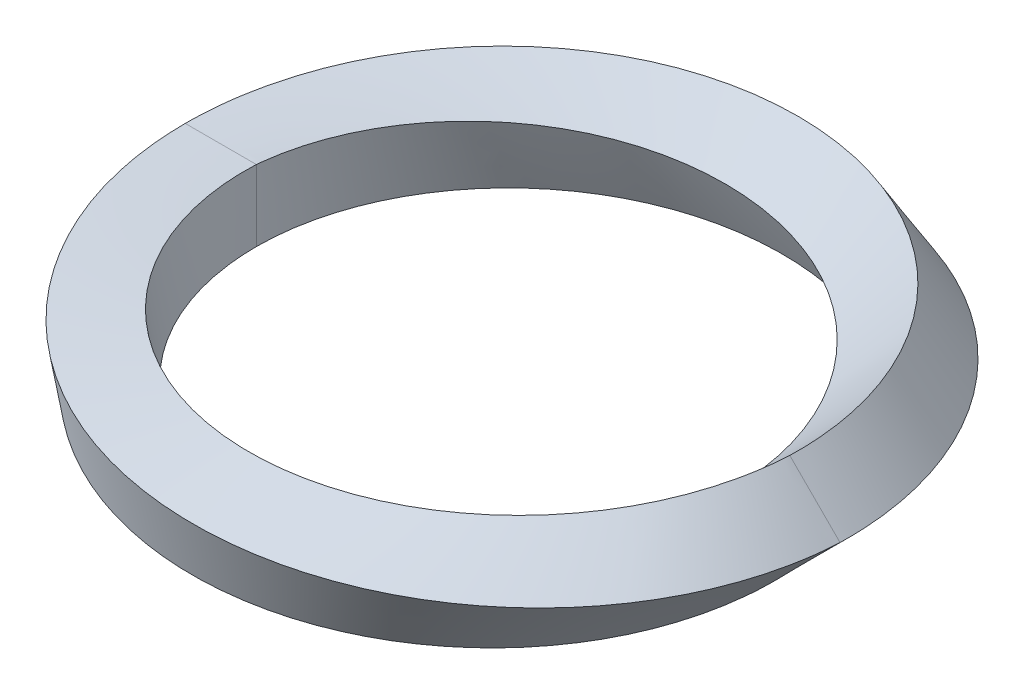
ISO-10303-21;
HEADER;
FILE_DESCRIPTION(('STEP AP214'),'2;1');
FILE_NAME('part.step','',(''),(''),'','','');
FILE_SCHEMA(('AUTOMOTIVE_DESIGN { 1 0 10303 214 1 1 1 1 }'));
ENDSEC;
DATA;
#1=APPLICATION_CONTEXT('core data for automotive mechanical design processes');
#2=APPLICATION_PROTOCOL_DEFINITION('international standard','automotive_design',2000,#1);
#3=PRODUCT_CONTEXT('',#1,'mechanical');
#4=PRODUCT('Part','Part','',(#3));
#5=PRODUCT_RELATED_PRODUCT_CATEGORY('part','',(#4));
#6=PRODUCT_DEFINITION_FORMATION('','',#4);
#7=PRODUCT_DEFINITION_CONTEXT('part definition',#1,'design');
#8=PRODUCT_DEFINITION('design','',#6,#7);
#9=PRODUCT_DEFINITION_SHAPE('','',#8);
#10=(LENGTH_UNIT() NAMED_UNIT(*) SI_UNIT(.MILLI.,.METRE.));
#11=(NAMED_UNIT(*) PLANE_ANGLE_UNIT() SI_UNIT($,.RADIAN.));
#12=(NAMED_UNIT(*) SI_UNIT($,.STERADIAN.) SOLID_ANGLE_UNIT());
#13=UNCERTAINTY_MEASURE_WITH_UNIT(LENGTH_MEASURE(1.E-05),#10,'distance_accuracy_value','');
#14=(GEOMETRIC_REPRESENTATION_CONTEXT(3) GLOBAL_UNCERTAINTY_ASSIGNED_CONTEXT((#13)) GLOBAL_UNIT_ASSIGNED_CONTEXT((#10,
#11,#12)) REPRESENTATION_CONTEXT('',''));
#15=CARTESIAN_POINT('',(0.,0.,0.));
#16=DIRECTION('',(0.,0.,1.));
#17=DIRECTION('',(1.,0.,0.));
#18=AXIS2_PLACEMENT_3D('',#15,#16,#17);
#19=CARTESIAN_POINT('',(100.,-17.6776695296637,0.));
#20=CARTESIAN_POINT('',(100.,-17.6776695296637,0.706207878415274));
#21=CARTESIAN_POINT('',(100.122711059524,-17.6773998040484,2.12998766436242));
#22=CARTESIAN_POINT('',(100.186385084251,-17.6749562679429,6.41816585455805));
#23=CARTESIAN_POINT('',(100.05491235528,-17.6667808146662,11.7952170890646));
#24=CARTESIAN_POINT('',(99.33522901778,-17.6471000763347,18.9582778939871));
#25=CARTESIAN_POINT('',(98.2589287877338,-17.6216951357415,25.4881786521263));
#26=CARTESIAN_POINT('',(96.5676192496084,-17.5851594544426,32.534297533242));
#27=CARTESIAN_POINT('',(93.942512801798,-17.5311881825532,40.8669991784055));
#28=CARTESIAN_POINT('',(89.6703732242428,-17.4470984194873,50.958855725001));
#29=CARTESIAN_POINT('',(83.1754509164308,-17.3238571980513,62.1422634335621));
#30=CARTESIAN_POINT('',(75.0258844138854,-17.1729679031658,72.7315968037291));
#31=CARTESIAN_POINT('',(68.011396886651,-17.0451809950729,79.755362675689));
#32=CARTESIAN_POINT('',(61.1799061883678,-16.9215051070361,85.5776361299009));
#33=CARTESIAN_POINT('',(53.9515600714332,-16.7912008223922,90.9699272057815));
#34=CARTESIAN_POINT('',(44.3651113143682,-16.6190371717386,96.5335965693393));
#35=CARTESIAN_POINT('',(36.041168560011,-16.4693714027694,100.218247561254));
#36=CARTESIAN_POINT('',(27.4818137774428,-16.3151018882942,103.358148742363));
#37=CARTESIAN_POINT('',(17.1869782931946,-16.1286528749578,106.157208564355));
#38=CARTESIAN_POINT('',(6.90793513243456,-15.9399670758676,107.554038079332));
#39=CARTESIAN_POINT('',(-2.30024557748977,-15.7686459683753,108.047911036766));
#40=CARTESIAN_POINT('',(-11.5575310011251,-15.5944670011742,107.94224194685));
#41=CARTESIAN_POINT('',(-23.44839950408,-15.3648627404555,106.44427816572));
#42=CARTESIAN_POINT('',(-32.5061393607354,-15.1835268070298,104.186849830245));
#43=CARTESIAN_POINT('',(-41.3970168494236,-15.0011652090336,101.345217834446));
#44=CARTESIAN_POINT('',(-50.8496931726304,-14.8012790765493,97.5089779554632));
#45=CARTESIAN_POINT('',(-60.1443573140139,-14.5914372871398,92.239929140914));
#46=CARTESIAN_POINT('',(-67.9243282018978,-14.4063621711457,86.9381371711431));
#47=CARTESIAN_POINT('',(-75.3678647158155,-14.2212494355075,81.124889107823));
#48=CARTESIAN_POINT('',(-82.8650189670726,-14.0167608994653,73.7745331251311));
#49=CARTESIAN_POINT('',(-88.9691501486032,-13.8330012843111,66.5133635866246));
#50=CARTESIAN_POINT('',(-94.5991770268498,-13.6500987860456,58.8599772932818));
#51=CARTESIAN_POINT('',(-99.3267410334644,-13.4738223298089,50.8973179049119));
#52=CARTESIAN_POINT('',(-103.420705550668,-13.2938664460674,42.2811921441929));
#53=CARTESIAN_POINT('',(-106.955230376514,-13.1153367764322,33.4026024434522));
#54=CARTESIAN_POINT('',(-109.138180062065,-12.96790236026,25.7138727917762));
#55=CARTESIAN_POINT('',(-110.935902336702,-12.8082115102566,17.1181477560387));
#56=CARTESIAN_POINT('',(-111.800806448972,-12.6972774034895,11.5432855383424));
#57=CARTESIAN_POINT('',(-112.334716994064,-12.5977633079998,4.77357917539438));
#58=CARTESIAN_POINT('',(-112.500022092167,-12.4999779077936,1.56981780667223));
#59=CARTESIAN_POINT('',(-112.500022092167,-12.4999779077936,-4.54324167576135E-13));
#60=CARTESIAN_POINT('',(117.677669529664,0.,0.));
#61=CARTESIAN_POINT('',(117.677669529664,0.,0.830190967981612));
#62=CARTESIAN_POINT('',(117.659678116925,0.137770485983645,2.5049140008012));
#63=CARTESIAN_POINT('',(117.496701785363,0.338189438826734,7.53211178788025));
#64=CARTESIAN_POINT('',(116.951415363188,0.665628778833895,13.7990798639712));
#65=CARTESIAN_POINT('',(115.639560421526,1.0582860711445,22.0792246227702));
#66=CARTESIAN_POINT('',(113.947217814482,1.42482534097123,29.5699693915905));
#67=CARTESIAN_POINT('',(111.516372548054,1.81966841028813,37.5823181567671));
#68=CARTESIAN_POINT('',(107.930267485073,2.29152355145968,46.975224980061));
#69=CARTESIAN_POINT('',(102.356215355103,2.87296680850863,58.2101393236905));
#70=CARTESIAN_POINT('',(94.2232939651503,3.54174631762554,70.4449550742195));
#71=CARTESIAN_POINT('',(84.3304022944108,4.21201045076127,81.8047109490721));
#72=CARTESIAN_POINT('',(76.0226647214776,4.6930926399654,89.1753635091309));
#73=CARTESIAN_POINT('',(68.0407706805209,5.11888349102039,95.1925435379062));
#74=CARTESIAN_POINT('',(59.6788101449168,5.53780715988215,100.685615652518));
#75=CARTESIAN_POINT('',(48.7697631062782,6.03349106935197,106.18135566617));
#76=CARTESIAN_POINT('',(39.4332573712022,6.42599949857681,109.678852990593));
#77=CARTESIAN_POINT('',(29.9106518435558,6.81017767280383,112.561026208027));
#78=CARTESIAN_POINT('',(18.5751200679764,7.24478676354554,114.956717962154));
#79=CARTESIAN_POINT('',(7.42487797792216,7.64634326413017,115.840898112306));
#80=CARTESIAN_POINT('',(-2.4752790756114,7.99249525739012,115.828121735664));
#81=CARTESIAN_POINT('',(-12.3586957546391,8.33032264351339,115.177964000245));
#82=CARTESIAN_POINT('',(-24.9023506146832,8.7466178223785,112.916143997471));
#83=CARTESIAN_POINT('',(-34.3416004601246,9.0546625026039,110.039120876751));
#84=CARTESIAN_POINT('',(-43.5467416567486,9.354250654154,106.574229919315));
#85=CARTESIAN_POINT('',(-53.2562928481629,9.66992748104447,102.057013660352));
#86=CARTESIAN_POINT('',(-62.6762705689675,9.98123540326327,96.0987761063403));
#87=CARTESIAN_POINT('',(-70.4940178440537,10.2458556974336,90.2143702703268));
#88=CARTESIAN_POINT('',(-77.9200257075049,10.5029301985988,83.840180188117));
#89=CARTESIAN_POINT('',(-85.301188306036,10.7735250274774,75.922477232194));
#90=CARTESIAN_POINT('',(-91.2377723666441,11.0074684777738,68.2009844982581));
#91=CARTESIAN_POINT('',(-96.6622953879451,11.2344203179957,60.1251028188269));
#92=CARTESIAN_POINT('',(-101.140728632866,11.4449412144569,51.8117153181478));
#93=CARTESIAN_POINT('',(-104.943228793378,11.6527743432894,42.8968818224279));
#94=CARTESIAN_POINT('',(-108.166139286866,11.8542057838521,33.7644540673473));
#95=CARTESIAN_POINT('',(-110.068560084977,12.0146077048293,25.924530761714));
#96=CARTESIAN_POINT('',(-111.553647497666,12.1844282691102,17.2084561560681));
#97=CARTESIAN_POINT('',(-112.196938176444,12.2998427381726,11.5793972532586));
#98=CARTESIAN_POINT('',(-112.530621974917,12.4018590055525,4.77777613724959));
#99=CARTESIAN_POINT('',(-112.499977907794,12.5000220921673,1.57098711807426));
#100=CARTESIAN_POINT('',(-112.499977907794,12.5000220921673,-4.54323989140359E-13));
#101=B_SPLINE_SURFACE_WITH_KNOTS('',1,3,((#19,#20,#21,#22,#23,#24,#25,#26,#27,#28,#29,#30,#31,
#32,#33,#34,#35,#36,#37,#38,#39,#40,#41,#42,#43,#44,#45,#46,#47,#48,#49,#50,#51,#52,#53,#54,#55,
#56,#57,#58,#59),(#60,#61,#62,#63,#64,#65,#66,#67,#68,#69,#70,#71,#72,#73,#74,#75,#76,#77,#78,
#79,#80,#81,#82,#83,#84,#85,#86,#87,#88,#89,#90,#91,#92,#93,#94,#95,#96,#97,#98,#99,#100)),
.UNSPECIFIED.,.F.,.F.,.F.,(2,2),(4,1,1,1,1,1,1,1,1,1,1,1,1,1,1,1,1,1,1,1,1,1,1,1,1,1,1,1,1,1,1,
1,1,1,1,1,1,1,4),(0.,1.),(0.,0.00673522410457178,0.0136127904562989,0.0408445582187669,
0.0577572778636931,0.0816897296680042,0.103174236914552,0.125752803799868,0.163362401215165,
0.204934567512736,0.245004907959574,0.285823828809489,0.295283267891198,0.326655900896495,
0.367471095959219,0.394995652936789,0.408302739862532,0.449113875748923,0.489922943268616,
0.500131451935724,0.530745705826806,0.57155070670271,0.605255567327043,0.612365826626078,
0.653166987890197,0.693966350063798,0.704923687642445,0.734780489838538,0.775576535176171,
0.795233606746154,0.816392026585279,0.857185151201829,0.874375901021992,0.897997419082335,
0.93878801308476,0.942296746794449,0.972790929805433,0.986674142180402,1.),.UNSPECIFIED.);
#102=CARTESIAN_POINT('',(100.,-17.6776695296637,0.));
#103=CARTESIAN_POINT('',(100.,-17.6776695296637,0.706207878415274));
#104=CARTESIAN_POINT('',(100.122711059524,-17.6773998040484,2.12998766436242));
#105=CARTESIAN_POINT('',(100.186385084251,-17.6749562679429,6.41816585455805));
#106=CARTESIAN_POINT('',(100.05491235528,-17.6667808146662,11.7952170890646));
#107=CARTESIAN_POINT('',(99.33522901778,-17.6471000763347,18.9582778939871));
#108=CARTESIAN_POINT('',(98.2589287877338,-17.6216951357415,25.4881786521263));
#109=CARTESIAN_POINT('',(96.5676192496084,-17.5851594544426,32.534297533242));
#110=CARTESIAN_POINT('',(93.942512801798,-17.5311881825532,40.8669991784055));
#111=CARTESIAN_POINT('',(89.6703732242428,-17.4470984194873,50.958855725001));
#112=CARTESIAN_POINT('',(83.1754509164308,-17.3238571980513,62.1422634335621));
#113=CARTESIAN_POINT('',(75.0258844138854,-17.1729679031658,72.7315968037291));
#114=CARTESIAN_POINT('',(68.011396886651,-17.0451809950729,79.755362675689));
#115=CARTESIAN_POINT('',(61.1799061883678,-16.9215051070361,85.5776361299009));
#116=CARTESIAN_POINT('',(53.9515600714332,-16.7912008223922,90.9699272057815));
#117=CARTESIAN_POINT('',(44.3651113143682,-16.6190371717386,96.5335965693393));
#118=CARTESIAN_POINT('',(36.041168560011,-16.4693714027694,100.218247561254));
#119=CARTESIAN_POINT('',(27.4818137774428,-16.3151018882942,103.358148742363));
#120=CARTESIAN_POINT('',(17.1869782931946,-16.1286528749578,106.157208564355));
#121=CARTESIAN_POINT('',(6.90793513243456,-15.9399670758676,107.554038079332));
#122=CARTESIAN_POINT('',(-2.30024557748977,-15.7686459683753,108.047911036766));
#123=CARTESIAN_POINT('',(-11.5575310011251,-15.5944670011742,107.94224194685));
#124=CARTESIAN_POINT('',(-23.4483995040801,-15.3648627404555,106.44427816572));
#125=CARTESIAN_POINT('',(-32.5061393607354,-15.1835268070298,104.186849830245));
#126=CARTESIAN_POINT('',(-41.3970168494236,-15.0011652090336,101.345217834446));
#127=CARTESIAN_POINT('',(-50.8496931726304,-14.8012790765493,97.5089779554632));
#128=CARTESIAN_POINT('',(-60.144357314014,-14.5914372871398,92.239929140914));
#129=CARTESIAN_POINT('',(-67.9243282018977,-14.4063621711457,86.9381371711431));
#130=CARTESIAN_POINT('',(-75.3678647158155,-14.2212494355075,81.124889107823));
#131=CARTESIAN_POINT('',(-82.8650189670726,-14.0167608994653,73.7745331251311));
#132=CARTESIAN_POINT('',(-88.9691501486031,-13.8330012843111,66.5133635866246));
#133=CARTESIAN_POINT('',(-94.5991770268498,-13.6500987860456,58.8599772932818));
#134=CARTESIAN_POINT('',(-99.3267410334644,-13.4738223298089,50.8973179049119));
#135=CARTESIAN_POINT('',(-103.420705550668,-13.2938664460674,42.2811921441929));
#136=CARTESIAN_POINT('',(-106.955230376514,-13.1153367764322,33.4026024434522));
#137=CARTESIAN_POINT('',(-109.138180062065,-12.96790236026,25.7138727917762));
#138=CARTESIAN_POINT('',(-110.935902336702,-12.8082115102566,17.1181477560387));
#139=CARTESIAN_POINT('',(-111.800806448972,-12.6972774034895,11.5432855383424));
#140=CARTESIAN_POINT('',(-112.334716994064,-12.5977633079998,4.77357917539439));
#141=CARTESIAN_POINT('',(-112.500022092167,-12.4999779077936,1.56981780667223));
#142=CARTESIAN_POINT('',(-112.500022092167,-12.4999779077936,-4.54324167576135E-13));
#143=B_SPLINE_CURVE_WITH_KNOTS('',3,(#102,#103,#104,#105,#106,#107,#108,#109,#110,#111,#112,
#113,#114,#115,#116,#117,#118,#119,#120,#121,#122,#123,#124,#125,#126,#127,#128,#129,#130,#131,
#132,#133,#134,#135,#136,#137,#138,#139,#140,#141,#142),.UNSPECIFIED.,.F.,.F.,(4,1,1,1,1,1,1,1,
1,1,1,1,1,1,1,1,1,1,1,1,1,1,1,1,1,1,1,1,1,1,1,1,1,1,1,1,1,1,4),(0.,0.00673522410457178,
0.0136127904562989,0.0408445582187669,0.0577572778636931,0.0816897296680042,0.103174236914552,
0.125752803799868,0.163362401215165,0.204934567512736,0.245004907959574,0.285823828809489,
0.295283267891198,0.326655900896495,0.367471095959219,0.394995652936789,0.408302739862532,
0.449113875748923,0.489922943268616,0.500131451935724,0.530745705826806,0.57155070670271,
0.605255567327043,0.612365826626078,0.653166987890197,0.693966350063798,0.704923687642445,
0.734780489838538,0.775576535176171,0.795233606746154,0.816392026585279,0.857185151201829,
0.874375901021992,0.897997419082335,0.93878801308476,0.942296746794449,0.972790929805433,
0.986674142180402,1.),.UNSPECIFIED.);
#144=CARTESIAN_POINT('',(100.000015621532,-17.6776657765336,2.07125932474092E-13));
#145=VERTEX_POINT('',#144);
#146=CARTESIAN_POINT('',(-112.500008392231,-12.4999863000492,-2.27162073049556E-13));
#147=VERTEX_POINT('',#146);
#148=EDGE_CURVE('E118',#145,#147,#143,.T.);
#149=CARTESIAN_POINT('',(117.677669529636,3.12430702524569E-05,4.87482059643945E-13));
#150=CARTESIAN_POINT('',(111.785123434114,-5.89253568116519,4.63072071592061E-13));
#151=CARTESIAN_POINT('',(105.892577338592,-11.7851026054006,4.38662083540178E-13));
#152=CARTESIAN_POINT('',(100.00003124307,-17.6776695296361,4.14252095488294E-13));
#153=B_SPLINE_CURVE_WITH_KNOTS('',3,(#149,#150,#151,#152),.UNSPECIFIED.,.F.,.F.,(4,4),(0.,1.),.UNSPECIFIED.);
#154=CARTESIAN_POINT('',(108.838644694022,-8.83902483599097,2.2543311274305E-13));
#155=VERTEX_POINT('',#154);
#156=EDGE_CURVE('E108',#155,#145,#153,.T.);
#157=CARTESIAN_POINT('',(117.677669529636,3.12430702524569E-05,4.87482059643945E-13));
#158=CARTESIAN_POINT('',(111.785123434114,-5.89253568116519,4.63072071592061E-13));
#159=CARTESIAN_POINT('',(105.892577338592,-11.7851026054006,4.38662083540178E-13));
#160=CARTESIAN_POINT('',(100.00003124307,-17.6776695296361,4.14252095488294E-13));
#161=B_SPLINE_CURVE_WITH_KNOTS('',3,(#157,#158,#159,#160),.UNSPECIFIED.,.F.,.F.,(4,4),(0.,1.),.UNSPECIFIED.);
#162=CARTESIAN_POINT('',(117.677665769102,1.56215317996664E-05,1.53661395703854E-07));
#163=VERTEX_POINT('',#162);
#164=EDGE_CURVE('E100',#163,#155,#161,.T.);
#165=CARTESIAN_POINT('',(117.677669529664,0.,0.));
#166=CARTESIAN_POINT('',(117.677669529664,0.,0.830190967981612));
#167=CARTESIAN_POINT('',(117.659678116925,0.137770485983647,2.5049140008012));
#168=CARTESIAN_POINT('',(117.496701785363,0.338189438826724,7.53211178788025));
#169=CARTESIAN_POINT('',(116.951415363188,0.66562877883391,13.7990798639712));
#170=CARTESIAN_POINT('',(115.639560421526,1.05828607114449,22.0792246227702));
#171=CARTESIAN_POINT('',(113.947217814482,1.42482534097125,29.5699693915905));
#172=CARTESIAN_POINT('',(111.516372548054,1.81966841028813,37.5823181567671));
#173=CARTESIAN_POINT('',(107.930267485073,2.29152355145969,46.975224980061));
#174=CARTESIAN_POINT('',(102.356215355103,2.87296680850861,58.2101393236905));
#175=CARTESIAN_POINT('',(94.2232939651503,3.54174631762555,70.4449550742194));
#176=CARTESIAN_POINT('',(84.3304022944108,4.21201045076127,81.8047109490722));
#177=CARTESIAN_POINT('',(76.0226647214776,4.6930926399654,89.1753635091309));
#178=CARTESIAN_POINT('',(68.0407706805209,5.11888349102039,95.1925435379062));
#179=CARTESIAN_POINT('',(59.6788101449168,5.53780715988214,100.685615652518));
#180=CARTESIAN_POINT('',(48.7697631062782,6.03349106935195,106.18135566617));
#181=CARTESIAN_POINT('',(39.4332573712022,6.42599949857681,109.678852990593));
#182=CARTESIAN_POINT('',(29.9106518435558,6.81017767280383,112.561026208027));
#183=CARTESIAN_POINT('',(18.5751200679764,7.24478676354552,114.956717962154));
#184=CARTESIAN_POINT('',(7.42487797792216,7.64634326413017,115.840898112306));
#185=CARTESIAN_POINT('',(-2.4752790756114,7.99249525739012,115.828121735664));
#186=CARTESIAN_POINT('',(-12.3586957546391,8.33032264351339,115.177964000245));
#187=CARTESIAN_POINT('',(-24.9023506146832,8.74661782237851,112.916143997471));
#188=CARTESIAN_POINT('',(-34.3416004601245,9.05466250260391,110.039120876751));
#189=CARTESIAN_POINT('',(-43.5467416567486,9.35425065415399,106.574229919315));
#190=CARTESIAN_POINT('',(-53.2562928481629,9.66992748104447,102.057013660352));
#191=CARTESIAN_POINT('',(-62.6762705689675,9.98123540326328,96.0987761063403));
#192=CARTESIAN_POINT('',(-70.4940178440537,10.2458556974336,90.2143702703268));
#193=CARTESIAN_POINT('',(-77.9200257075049,10.5029301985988,83.840180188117));
#194=CARTESIAN_POINT('',(-85.301188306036,10.7735250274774,75.922477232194));
#195=CARTESIAN_POINT('',(-91.2377723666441,11.0074684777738,68.2009844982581));
#196=CARTESIAN_POINT('',(-96.6622953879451,11.2344203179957,60.1251028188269));
#197=CARTESIAN_POINT('',(-101.140728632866,11.4449412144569,51.8117153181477));
#198=CARTESIAN_POINT('',(-104.943228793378,11.6527743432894,42.8968818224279));
#199=CARTESIAN_POINT('',(-108.166139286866,11.8542057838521,33.7644540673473));
#200=CARTESIAN_POINT('',(-110.068560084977,12.0146077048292,25.924530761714));
#201=CARTESIAN_POINT('',(-111.553647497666,12.1844282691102,17.2084561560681));
#202=CARTESIAN_POINT('',(-112.196938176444,12.2998427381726,11.5793972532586));
#203=CARTESIAN_POINT('',(-112.530621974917,12.4018590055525,4.77777613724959));
#204=CARTESIAN_POINT('',(-112.499977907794,12.5000220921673,1.57098711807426));
#205=CARTESIAN_POINT('',(-112.499977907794,12.5000220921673,-4.54323989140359E-13));
#206=B_SPLINE_CURVE_WITH_KNOTS('',3,(#165,#166,#167,#168,#169,#170,#171,#172,#173,#174,#175,
#176,#177,#178,#179,#180,#181,#182,#183,#184,#185,#186,#187,#188,#189,#190,#191,#192,#193,#194,
#195,#196,#197,#198,#199,#200,#201,#202,#203,#204,#205),.UNSPECIFIED.,.F.,.F.,(4,1,1,1,1,1,1,1,
1,1,1,1,1,1,1,1,1,1,1,1,1,1,1,1,1,1,1,1,1,1,1,1,1,1,1,1,1,1,4),(0.,0.00673522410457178,
0.0136127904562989,0.0408445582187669,0.0577572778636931,0.0816897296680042,0.103174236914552,
0.125752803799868,0.163362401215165,0.204934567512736,0.245004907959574,0.285823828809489,
0.295283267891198,0.326655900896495,0.367471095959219,0.394995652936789,0.408302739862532,
0.449113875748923,0.489922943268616,0.500131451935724,0.530745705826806,0.57155070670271,
0.605255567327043,0.612365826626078,0.653166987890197,0.693966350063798,0.704923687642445,
0.734780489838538,0.775576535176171,0.795233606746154,0.816392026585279,0.857185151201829,
0.874375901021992,0.897997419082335,0.93878801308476,0.942296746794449,0.972790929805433,
0.986674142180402,1.),.UNSPECIFIED.);
#207=CARTESIAN_POINT('',(-112.499986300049,12.5000083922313,-2.27161994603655E-13));
#208=VERTEX_POINT('',#207);
#209=EDGE_CURVE('E301',#208,#163,#206,.F.);
#210=CARTESIAN_POINT('',(-112.499977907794,12.5000220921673,-4.54323989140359E-13));
#211=CARTESIAN_POINT('',(-112.500022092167,-12.4999779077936,-4.54324167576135E-13));
#212=B_SPLINE_CURVE_WITH_KNOTS('',1,(#210,#211),.UNSPECIFIED.,.F.,.F.,(2,2),(0.,1.),.UNSPECIFIED.);
#213=CARTESIAN_POINT('',(-112.5,1.1017029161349E-05,-2.27162039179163E-13));
#214=VERTEX_POINT('',#213);
#215=EDGE_CURVE('E291',#208,#214,#212,.T.);
#216=CARTESIAN_POINT('',(-112.499977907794,12.5000220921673,-4.54323989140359E-13));
#217=CARTESIAN_POINT('',(-112.500022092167,-12.4999779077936,-4.54324167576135E-13));
#218=B_SPLINE_CURVE_WITH_KNOTS('',1,(#216,#217),.UNSPECIFIED.,.F.,.F.,(2,2),(0.,1.),.UNSPECIFIED.);
#219=EDGE_CURVE('E237',#214,#147,#218,.T.);
#220=ORIENTED_EDGE('',*,*,#148,.F.);
#221=ORIENTED_EDGE('',*,*,#156,.F.);
#222=ORIENTED_EDGE('',*,*,#164,.F.);
#223=ORIENTED_EDGE('',*,*,#209,.F.);
#224=ORIENTED_EDGE('',*,*,#215,.T.);
#225=ORIENTED_EDGE('',*,*,#219,.T.);
#226=EDGE_LOOP('',(#220,#221,#222,#223,#224,#225));
#227=FACE_BOUND('',#226,.T.);
#228=ADVANCED_FACE('F31',(#227),#101,.T.);
#229=CARTESIAN_POINT('',(-87.5,-12.5,0.));
#230=CARTESIAN_POINT('',(-87.5,-12.5,-0.618160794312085));
#231=CARTESIAN_POINT('',(-87.5844323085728,-12.5972277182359,-1.86335084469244));
#232=CARTESIAN_POINT('',(-87.6082786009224,-12.7372174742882,-5.6132338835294));
#233=CARTESIAN_POINT('',(-87.4444513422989,-12.9629711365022,-10.3099345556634));
#234=CARTESIAN_POINT('',(-86.7647535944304,-13.2267053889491,-16.5601385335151));
#235=CARTESIAN_POINT('',(-85.7828909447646,-13.4679237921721,-22.2529891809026));
#236=CARTESIAN_POINT('',(-84.2686956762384,-13.7212853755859,-28.3915645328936));
#237=CARTESIAN_POINT('',(-81.9409944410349,-14.0167738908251,-35.6475069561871));
#238=CARTESIAN_POINT('',(-78.1825480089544,-14.3684559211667,-44.4320272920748));
#239=CARTESIAN_POINT('',(-72.5014670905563,-14.7542097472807,-54.1681916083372));
#240=CARTESIAN_POINT('',(-65.395622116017,-15.1214632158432,-63.395483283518));
#241=CARTESIAN_POINT('',(-59.2890060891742,-15.371280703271,-69.5261091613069));
#242=CARTESIAN_POINT('',(-53.3436698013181,-15.5849082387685,-74.6158714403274));
#243=CARTESIAN_POINT('',(-47.053909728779,-15.7889929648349,-79.3368481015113));
#244=CARTESIAN_POINT('',(-38.7104319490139,-16.0177563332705,-84.2254688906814));
#245=CARTESIAN_POINT('',(-31.460701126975,-16.1894720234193,-87.4793397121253));
#246=CARTESIAN_POINT('',(-24.0016464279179,-16.3520419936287,-90.2638758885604));
#247=CARTESIAN_POINT('',(-15.0227177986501,-16.5275176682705,-92.7671741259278));
#248=CARTESIAN_POINT('',(-6.04267483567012,-16.6780399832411,-94.0547609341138));
#249=CARTESIAN_POINT('',(2.01178360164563,-16.8016640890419,-94.5499160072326));
#250=CARTESIAN_POINT('',(10.117406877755,-16.9173809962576,-94.5239388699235));
#251=CARTESIAN_POINT('',(20.5494527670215,-17.0493914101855,-93.3030091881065));
#252=CARTESIAN_POINT('',(28.5140816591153,-17.1389880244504,-91.3965087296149));
#253=CARTESIAN_POINT('',(36.342421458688,-17.2218797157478,-88.9762148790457));
#254=CARTESIAN_POINT('',(44.6790809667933,-17.303756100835,-85.6876864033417));
#255=CARTESIAN_POINT('',(52.9013186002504,-17.3755034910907,-81.1361580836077));
#256=CARTESIAN_POINT('',(59.7979392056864,-17.4317504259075,-76.5393335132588));
#257=CARTESIAN_POINT('',(66.4079960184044,-17.4826350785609,-71.4868209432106));
#258=CARTESIAN_POINT('',(73.0881766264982,-17.5293792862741,-65.0745925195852));
#259=CARTESIAN_POINT('',(78.5448376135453,-17.5648646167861,-58.7219274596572));
#260=CARTESIAN_POINT('',(83.590295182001,-17.5960122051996,-52.0142413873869));
#261=CARTESIAN_POINT('',(87.8463372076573,-17.6202266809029,-45.0179669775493));
#262=CARTESIAN_POINT('',(91.551646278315,-17.6399388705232,-37.4303710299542));
#263=CARTESIAN_POINT('',(94.7663190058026,-17.6561328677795,-29.5998408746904));
#264=CARTESIAN_POINT('',(96.774934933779,-17.6653022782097,-22.8031157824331));
#265=CARTESIAN_POINT('',(98.450679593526,-17.672465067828,-15.1928440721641));
#266=CARTESIAN_POINT('',(99.2757224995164,-17.6756331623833,-10.2513436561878));
#267=CARTESIAN_POINT('',(99.8017930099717,-17.6774024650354,-4.24202253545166));
#268=CARTESIAN_POINT('',(100.00003124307,-17.6776695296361,-1.39520557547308));
#269=CARTESIAN_POINT('',(100.00003124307,-17.6776695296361,4.14252095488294E-13));
#270=CARTESIAN_POINT('',(-95.8333333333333,-12.5,0.));
#271=CARTESIAN_POINT('',(-95.8333333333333,-12.5,-0.676788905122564));
#272=CARTESIAN_POINT('',(-95.9163834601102,-12.5322820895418,-2.04080941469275));
#273=CARTESIAN_POINT('',(-95.927710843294,-12.5777934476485,-6.14648834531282));
#274=CARTESIAN_POINT('',(-95.7219999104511,-12.6491907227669,-11.2867786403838));
#275=CARTESIAN_POINT('',(-94.9416909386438,-12.7278245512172,-18.1215452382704));
#276=CARTESIAN_POINT('',(-93.8302522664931,-12.7962546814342,-24.3416498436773));
#277=CARTESIAN_POINT('',(-92.1304559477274,-12.8634854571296,-31.0414538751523));
#278=CARTESIAN_POINT('',(-89.5298703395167,-12.9365393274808,-38.9513692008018));
#279=CARTESIAN_POINT('',(-85.3495100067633,-13.0141263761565,-48.5099971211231));
#280=CARTESIAN_POINT('',(-79.0586200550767,-13.0846145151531,-59.0735677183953));
#281=CARTESIAN_POINT('',(-71.2200570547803,-13.135902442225,-69.0493051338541));
#282=CARTESIAN_POINT('',(-64.5069057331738,-13.1589356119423,-75.6488562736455));
#283=CARTESIAN_POINT('',(-57.9849947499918,-13.1718434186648,-81.1108385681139));
#284=CARTESIAN_POINT('',(-51.0962614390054,-13.1784456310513,-86.1621908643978));
#285=CARTESIAN_POINT('',(-41.9842288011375,-13.1735413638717,-91.3596535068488));
#286=CARTESIAN_POINT('',(-34.0883038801,-13.1602268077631,-94.7907554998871));
#287=CARTESIAN_POINT('',(-25.9775656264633,-13.1416934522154,-97.7072275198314));
#288=CARTESIAN_POINT('',(-16.2346223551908,-13.1122924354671,-100.294255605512));
#289=CARTESIAN_POINT('',(-6.52193741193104,-13.073519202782,-101.562557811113));
#290=CARTESIAN_POINT('',(2.17193294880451,-13.0339656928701,-101.987154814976));
#291=CARTESIAN_POINT('',(10.906905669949,-12.9904292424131,-101.848432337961));
#292=CARTESIAN_POINT('',(22.1167781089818,-12.9261962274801,-100.391440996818));
#293=CARTESIAN_POINT('',(30.6493799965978,-12.8705791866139,-98.2339633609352));
#294=CARTESIAN_POINT('',(39.0219956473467,-12.8122436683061,-95.528994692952));
#295=CARTESIAN_POINT('',(47.9202175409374,-12.745308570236,-91.8882493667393));
#296=CARTESIAN_POINT('',(56.6653040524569,-12.6703039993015,-86.9033215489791));
#297=CARTESIAN_POINT('',(63.9835558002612,-12.6018077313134,-81.8937299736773));
#298=CARTESIAN_POINT('',(70.9840985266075,-12.5315063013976,-76.405153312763));
#299=CARTESIAN_POINT('',(78.0333890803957,-12.4506908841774,-69.472353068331));
#300=CARTESIAN_POINT('',(83.7721370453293,-12.375894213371,-62.6278574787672));
#301=CARTESIAN_POINT('',(89.0647890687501,-12.3000556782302,-55.416029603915));
#302=CARTESIAN_POINT('',(93.5087108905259,-12.2250296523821,-47.915771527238));
#303=CARTESIAN_POINT('',(97.3569911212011,-12.146768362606,-39.8020789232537));
#304=CARTESIAN_POINT('',(100.679418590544,-12.0680066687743,-31.442441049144));
#305=CARTESIAN_POINT('',(102.731483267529,-12.001561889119,-24.2043455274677));
#306=CARTESIAN_POINT('',(104.421562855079,-11.9286704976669,-16.1129098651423));
#307=CARTESIAN_POINT('',(105.23479808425,-11.8774316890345,-10.8653572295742));
#308=CARTESIAN_POINT('',(105.736918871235,-11.8311100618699,-4.49317951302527));
#309=CARTESIAN_POINT('',(105.892577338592,-11.7851026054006,-1.47768130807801));
#310=CARTESIAN_POINT('',(105.892577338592,-11.7851026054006,4.38662083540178E-13));
#311=CARTESIAN_POINT('',(-104.166666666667,-12.5,0.));
#312=CARTESIAN_POINT('',(-104.166666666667,-12.5,-0.735417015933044));
#313=CARTESIAN_POINT('',(-104.248334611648,-12.4673364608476,-2.21826798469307));
#314=CARTESIAN_POINT('',(-104.247143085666,-12.4183694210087,-6.67974280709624));
#315=CARTESIAN_POINT('',(-103.999548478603,-12.3354103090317,-12.2636227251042));
#316=CARTESIAN_POINT('',(-103.118628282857,-12.2289437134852,-19.6829519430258));
#317=CARTESIAN_POINT('',(-101.877613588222,-12.1245855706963,-26.4303105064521));
#318=CARTESIAN_POINT('',(-99.9922162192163,-12.0056855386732,-33.691343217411));
#319=CARTESIAN_POINT('',(-97.1187462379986,-11.8563047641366,-42.2552314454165));
#320=CARTESIAN_POINT('',(-92.5164720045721,-11.6597968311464,-52.5879669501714));
#321=CARTESIAN_POINT('',(-85.6157730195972,-11.4150192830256,-63.9789438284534));
#322=CARTESIAN_POINT('',(-77.0444919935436,-11.1503416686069,-74.7031269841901));
#323=CARTESIAN_POINT('',(-69.7248053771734,-10.9465905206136,-81.7716033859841));
#324=CARTESIAN_POINT('',(-62.6263196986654,-10.758778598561,-87.6058056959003));
#325=CARTESIAN_POINT('',(-55.1386131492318,-10.5678982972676,-92.9875336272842));
#326=CARTESIAN_POINT('',(-45.2580256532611,-10.3293263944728,-98.4938381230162));
#327=CARTESIAN_POINT('',(-36.7159066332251,-10.1309815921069,-102.102171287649));
#328=CARTESIAN_POINT('',(-27.9534848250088,-9.9313449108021,-105.150579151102));
#329=CARTESIAN_POINT('',(-17.4465269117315,-9.69706720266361,-107.821337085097));
#330=CARTESIAN_POINT('',(-7.00119998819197,-9.46899842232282,-109.070354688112));
#331=CARTESIAN_POINT('',(2.33208229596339,-9.26626729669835,-109.424393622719));
#332=CARTESIAN_POINT('',(11.696404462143,-9.0634774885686,-109.172925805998));
#333=CARTESIAN_POINT('',(23.6841034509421,-8.80300104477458,-107.479872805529));
#334=CARTESIAN_POINT('',(32.7846783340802,-8.60217034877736,-105.071417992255));
#335=CARTESIAN_POINT('',(41.7015698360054,-8.40260762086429,-102.081774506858));
#336=CARTESIAN_POINT('',(51.1613541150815,-8.18686103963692,-98.0888123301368));
#337=CARTESIAN_POINT('',(60.4292895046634,-7.96510450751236,-92.6704850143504));
#338=CARTESIAN_POINT('',(68.1691723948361,-7.77186503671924,-87.2481264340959));
#339=CARTESIAN_POINT('',(75.5602010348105,-7.5803775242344,-81.3234856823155));
#340=CARTESIAN_POINT('',(82.9786015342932,-7.37200248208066,-73.870113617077));
#341=CARTESIAN_POINT('',(88.9994364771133,-7.18692380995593,-66.5337874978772));
#342=CARTESIAN_POINT('',(94.5392829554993,-7.00409915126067,-58.817817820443));
#343=CARTESIAN_POINT('',(99.1710845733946,-6.82983262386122,-50.8135760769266));
#344=CARTESIAN_POINT('',(103.162335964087,-6.65359785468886,-42.1737868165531));
#345=CARTESIAN_POINT('',(106.592518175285,-6.47988046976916,-33.2850412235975));
#346=CARTESIAN_POINT('',(108.688031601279,-6.33782150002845,-25.6055752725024));
#347=CARTESIAN_POINT('',(110.392446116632,-6.18487592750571,-17.0329756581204));
#348=CARTESIAN_POINT('',(111.193873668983,-6.07923021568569,-11.4793708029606));
#349=CARTESIAN_POINT('',(111.672044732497,-5.98481765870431,-4.74433649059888));
#350=CARTESIAN_POINT('',(111.785123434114,-5.89253568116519,-1.56015704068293));
#351=CARTESIAN_POINT('',(111.785123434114,-5.89253568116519,4.63072071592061E-13));
#352=CARTESIAN_POINT('',(-112.5,-12.5,0.));
#353=CARTESIAN_POINT('',(-112.5,-12.5,-0.794045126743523));
#354=CARTESIAN_POINT('',(-112.580285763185,-12.4023908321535,-2.39572655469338));
#355=CARTESIAN_POINT('',(-112.566575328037,-12.258945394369,-7.21299726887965));
#356=CARTESIAN_POINT('',(-112.277097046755,-12.0216298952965,-13.2404668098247));
#357=CARTESIAN_POINT('',(-111.29556562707,-11.7300628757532,-21.2443586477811));
#358=CARTESIAN_POINT('',(-109.92497490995,-11.4529164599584,-28.5189711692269));
#359=CARTESIAN_POINT('',(-107.853976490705,-11.1478856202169,-36.3412325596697));
#360=CARTESIAN_POINT('',(-104.70762213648,-10.7760702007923,-45.5590936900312));
#361=CARTESIAN_POINT('',(-99.683434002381,-10.3054672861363,-56.6659367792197));
#362=CARTESIAN_POINT('',(-92.1729259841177,-9.74542405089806,-68.8843199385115));
#363=CARTESIAN_POINT('',(-82.8689269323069,-9.16478089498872,-80.3569488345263));
#364=CARTESIAN_POINT('',(-74.9427050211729,-8.73424542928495,-87.8943504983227));
#365=CARTESIAN_POINT('',(-67.2676446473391,-8.34571377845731,-94.1007728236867));
#366=CARTESIAN_POINT('',(-59.1809648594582,-7.95735096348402,-99.8128763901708));
#367=CARTESIAN_POINT('',(-48.5318225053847,-7.48511142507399,-105.628022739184));
#368=CARTESIAN_POINT('',(-39.3435093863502,-7.10173637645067,-109.413587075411));
#369=CARTESIAN_POINT('',(-29.9294040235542,-6.72099636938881,-112.593930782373));
#370=CARTESIAN_POINT('',(-18.6584314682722,-6.28184196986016,-115.348418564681));
#371=CARTESIAN_POINT('',(-7.48046256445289,-5.86447764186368,-116.578151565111));
#372=CARTESIAN_POINT('',(2.49223164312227,-5.49856890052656,-116.861632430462));
#373=CARTESIAN_POINT('',(12.485903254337,-5.13652573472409,-116.497419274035));
#374=CARTESIAN_POINT('',(25.2514287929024,-4.67980586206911,-114.56830461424));
#375=CARTESIAN_POINT('',(34.9199766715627,-4.33376151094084,-111.908872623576));
#376=CARTESIAN_POINT('',(44.3811440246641,-3.99297157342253,-108.634554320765));
#377=CARTESIAN_POINT('',(54.4024906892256,-3.62841350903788,-104.289375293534));
#378=CARTESIAN_POINT('',(64.19327495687,-3.25990501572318,-98.4376484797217));
#379=CARTESIAN_POINT('',(72.3547889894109,-2.94192234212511,-92.6025228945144));
#380=CARTESIAN_POINT('',(80.1363035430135,-2.62924874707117,-86.241818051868));
#381=CARTESIAN_POINT('',(87.9238139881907,-2.29331407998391,-78.2678741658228));
#382=CARTESIAN_POINT('',(94.2267359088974,-1.99795340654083,-70.4397175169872));
#383=CARTESIAN_POINT('',(100.013776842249,-1.7081426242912,-62.2196060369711));
#384=CARTESIAN_POINT('',(104.833458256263,-1.43463559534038,-53.7113806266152));
#385=CARTESIAN_POINT('',(108.967680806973,-1.16042734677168,-44.5454947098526));
#386=CARTESIAN_POINT('',(112.505617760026,-0.891754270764,-35.1276413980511));
#387=CARTESIAN_POINT('',(114.644579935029,-0.674081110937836,-27.0068050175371));
#388=CARTESIAN_POINT('',(116.363329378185,-0.441081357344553,-17.9530414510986));
#389=CARTESIAN_POINT('',(117.152949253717,-0.281028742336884,-12.093384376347));
#390=CARTESIAN_POINT('',(117.60717059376,-0.138525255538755,-4.9954934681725));
#391=CARTESIAN_POINT('',(117.677669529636,3.12430702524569E-05,-1.64263277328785));
#392=CARTESIAN_POINT('',(117.677669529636,3.12430702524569E-05,4.87482059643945E-13));
#393=B_SPLINE_SURFACE_WITH_KNOTS('',3,3,((#229,#230,#231,#232,#233,#234,#235,#236,#237,#238,
#239,#240,#241,#242,#243,#244,#245,#246,#247,#248,#249,#250,#251,#252,#253,#254,#255,#256,#257,
#258,#259,#260,#261,#262,#263,#264,#265,#266,#267,#268,#269),(#270,#271,#272,#273,#274,#275,
#276,#277,#278,#279,#280,#281,#282,#283,#284,#285,#286,#287,#288,#289,#290,#291,#292,#293,#294,
#295,#296,#297,#298,#299,#300,#301,#302,#303,#304,#305,#306,#307,#308,#309,#310),(#311,#312,
#313,#314,#315,#316,#317,#318,#319,#320,#321,#322,#323,#324,#325,#326,#327,#328,#329,#330,#331,
#332,#333,#334,#335,#336,#337,#338,#339,#340,#341,#342,#343,#344,#345,#346,#347,#348,#349,#350,
#351),(#352,#353,#354,#355,#356,#357,#358,#359,#360,#361,#362,#363,#364,#365,#366,#367,#368,
#369,#370,#371,#372,#373,#374,#375,#376,#377,#378,#379,#380,#381,#382,#383,#384,#385,#386,#387,
#388,#389,#390,#391,#392)),.UNSPECIFIED.,.F.,.F.,.F.,(4,4),(4,1,1,1,1,1,1,1,1,1,1,1,1,1,1,1,1,1,
1,1,1,1,1,1,1,1,1,1,1,1,1,1,1,1,1,1,1,1,4),(0.,1.),(0.,0.0067352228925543,0.0136127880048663,
0.0408445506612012,0.0577572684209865,0.0816897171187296,0.103174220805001,0.125752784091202,
0.163362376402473,0.204934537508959,0.245004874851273,0.285823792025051,0.295283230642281,
0.326655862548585,0.367471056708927,0.394995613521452,0.408302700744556,0.449113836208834,
0.489922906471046,0.500131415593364,0.530745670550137,0.571550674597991,0.605255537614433,
0.612365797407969,0.653166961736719,0.693966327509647,0.70492366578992,0.734780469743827,
0.775576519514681,0.795233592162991,0.816392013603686,0.857185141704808,0.874375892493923,
0.897997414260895,0.938788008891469,0.94229674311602,0.972790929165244,0.986674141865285,1.),.UNSPECIFIED.);
#394=CARTESIAN_POINT('',(-112.500022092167,-12.4999779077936,-1.01397473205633E-13));
#395=CARTESIAN_POINT('',(-87.5000220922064,-12.5000220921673,0.));
#396=B_SPLINE_CURVE_WITH_KNOTS('',1,(#394,#395),.UNSPECIFIED.,.F.,.F.,(2,2),(0.,1.),.UNSPECIFIED.);
#397=CARTESIAN_POINT('',(-100.000006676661,-12.5000000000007,-2.24164938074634E-13));
#398=VERTEX_POINT('',#397);
#399=EDGE_CURVE('E538',#147,#398,#396,.T.);
#400=CARTESIAN_POINT('',(-112.5,-12.5,0.));
#401=CARTESIAN_POINT('',(-112.5,-12.5,-0.794045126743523));
#402=CARTESIAN_POINT('',(-112.580285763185,-12.4023908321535,-2.39572655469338));
#403=CARTESIAN_POINT('',(-112.566575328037,-12.258945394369,-7.21299726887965));
#404=CARTESIAN_POINT('',(-112.277097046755,-12.0216298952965,-13.2404668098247));
#405=CARTESIAN_POINT('',(-111.29556562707,-11.7300628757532,-21.2443586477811));
#406=CARTESIAN_POINT('',(-109.92497490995,-11.4529164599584,-28.5189711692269));
#407=CARTESIAN_POINT('',(-107.853976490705,-11.1478856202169,-36.3412325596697));
#408=CARTESIAN_POINT('',(-104.70762213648,-10.7760702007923,-45.5590936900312));
#409=CARTESIAN_POINT('',(-99.683434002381,-10.3054672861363,-56.6659367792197));
#410=CARTESIAN_POINT('',(-92.1729259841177,-9.74542405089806,-68.8843199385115));
#411=CARTESIAN_POINT('',(-82.8689269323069,-9.16478089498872,-80.3569488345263));
#412=CARTESIAN_POINT('',(-74.9427050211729,-8.73424542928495,-87.8943504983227));
#413=CARTESIAN_POINT('',(-67.2676446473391,-8.34571377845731,-94.1007728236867));
#414=CARTESIAN_POINT('',(-59.1809648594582,-7.95735096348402,-99.8128763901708));
#415=CARTESIAN_POINT('',(-48.5318225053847,-7.48511142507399,-105.628022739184));
#416=CARTESIAN_POINT('',(-39.3435093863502,-7.10173637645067,-109.413587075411));
#417=CARTESIAN_POINT('',(-29.9294040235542,-6.72099636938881,-112.593930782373));
#418=CARTESIAN_POINT('',(-18.6584314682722,-6.28184196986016,-115.348418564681));
#419=CARTESIAN_POINT('',(-7.48046256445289,-5.86447764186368,-116.578151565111));
#420=CARTESIAN_POINT('',(2.49223164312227,-5.49856890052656,-116.861632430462));
#421=CARTESIAN_POINT('',(12.485903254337,-5.13652573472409,-116.497419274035));
#422=CARTESIAN_POINT('',(25.2514287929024,-4.67980586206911,-114.56830461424));
#423=CARTESIAN_POINT('',(34.9199766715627,-4.33376151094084,-111.908872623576));
#424=CARTESIAN_POINT('',(44.3811440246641,-3.99297157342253,-108.634554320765));
#425=CARTESIAN_POINT('',(54.4024906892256,-3.62841350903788,-104.289375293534));
#426=CARTESIAN_POINT('',(64.19327495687,-3.25990501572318,-98.4376484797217));
#427=CARTESIAN_POINT('',(72.3547889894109,-2.94192234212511,-92.6025228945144));
#428=CARTESIAN_POINT('',(80.1363035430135,-2.62924874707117,-86.241818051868));
#429=CARTESIAN_POINT('',(87.9238139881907,-2.29331407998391,-78.2678741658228));
#430=CARTESIAN_POINT('',(94.2267359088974,-1.99795340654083,-70.4397175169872));
#431=CARTESIAN_POINT('',(100.013776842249,-1.7081426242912,-62.2196060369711));
#432=CARTESIAN_POINT('',(104.833458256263,-1.43463559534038,-53.7113806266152));
#433=CARTESIAN_POINT('',(108.967680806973,-1.16042734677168,-44.5454947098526));
#434=CARTESIAN_POINT('',(112.505617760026,-0.891754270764,-35.1276413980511));
#435=CARTESIAN_POINT('',(114.644579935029,-0.674081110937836,-27.0068050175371));
#436=CARTESIAN_POINT('',(116.363329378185,-0.441081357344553,-17.9530414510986));
#437=CARTESIAN_POINT('',(117.152949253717,-0.281028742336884,-12.093384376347));
#438=CARTESIAN_POINT('',(117.60717059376,-0.138525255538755,-4.9954934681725));
#439=CARTESIAN_POINT('',(117.677669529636,3.12430702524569E-05,-1.64263277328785));
#440=CARTESIAN_POINT('',(117.677669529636,3.12430702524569E-05,4.87482059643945E-13));
#441=B_SPLINE_CURVE_WITH_KNOTS('',3,(#400,#401,#402,#403,#404,#405,#406,#407,#408,#409,#410,
#411,#412,#413,#414,#415,#416,#417,#418,#419,#420,#421,#422,#423,#424,#425,#426,#427,#428,#429,
#430,#431,#432,#433,#434,#435,#436,#437,#438,#439,#440),.UNSPECIFIED.,.F.,.F.,(4,1,1,1,1,1,1,1,
1,1,1,1,1,1,1,1,1,1,1,1,1,1,1,1,1,1,1,1,1,1,1,1,1,1,1,1,1,1,4),(0.,0.0067352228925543,
0.0136127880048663,0.0408445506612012,0.0577572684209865,0.0816897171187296,0.103174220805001,
0.125752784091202,0.163362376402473,0.204934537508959,0.245004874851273,0.285823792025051,
0.295283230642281,0.326655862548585,0.367471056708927,0.394995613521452,0.408302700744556,
0.449113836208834,0.489922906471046,0.500131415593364,0.530745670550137,0.571550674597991,
0.605255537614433,0.612365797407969,0.653166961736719,0.693966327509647,0.70492366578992,
0.734780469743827,0.775576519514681,0.795233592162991,0.816392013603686,0.857185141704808,
0.874375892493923,0.897997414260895,0.938788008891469,0.94229674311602,0.972790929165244,
0.986674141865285,1.),.UNSPECIFIED.);
#442=EDGE_CURVE('E112',#147,#163,#441,.T.);
#443=CARTESIAN_POINT('',(-87.5,-12.5,0.));
#444=CARTESIAN_POINT('',(-87.5,-12.5,-0.618160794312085));
#445=CARTESIAN_POINT('',(-87.5844323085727,-12.5972277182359,-1.86335084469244));
#446=CARTESIAN_POINT('',(-87.6082786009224,-12.7372174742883,-5.6132338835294));
#447=CARTESIAN_POINT('',(-87.4444513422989,-12.9629711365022,-10.3099345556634));
#448=CARTESIAN_POINT('',(-86.7647535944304,-13.2267053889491,-16.5601385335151));
#449=CARTESIAN_POINT('',(-85.7828909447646,-13.4679237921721,-22.2529891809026));
#450=CARTESIAN_POINT('',(-84.2686956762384,-13.7212853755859,-28.3915645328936));
#451=CARTESIAN_POINT('',(-81.9409944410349,-14.0167738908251,-35.6475069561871));
#452=CARTESIAN_POINT('',(-78.1825480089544,-14.3684559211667,-44.4320272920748));
#453=CARTESIAN_POINT('',(-72.5014670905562,-14.7542097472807,-54.1681916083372));
#454=CARTESIAN_POINT('',(-65.395622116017,-15.1214632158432,-63.395483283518));
#455=CARTESIAN_POINT('',(-59.2890060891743,-15.371280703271,-69.5261091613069));
#456=CARTESIAN_POINT('',(-53.3436698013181,-15.5849082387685,-74.6158714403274));
#457=CARTESIAN_POINT('',(-47.053909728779,-15.7889929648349,-79.3368481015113));
#458=CARTESIAN_POINT('',(-38.7104319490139,-16.0177563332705,-84.2254688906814));
#459=CARTESIAN_POINT('',(-31.460701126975,-16.1894720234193,-87.4793397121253));
#460=CARTESIAN_POINT('',(-24.0016464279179,-16.3520419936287,-90.2638758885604));
#461=CARTESIAN_POINT('',(-15.0227177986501,-16.5275176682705,-92.7671741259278));
#462=CARTESIAN_POINT('',(-6.04267483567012,-16.6780399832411,-94.0547609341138));
#463=CARTESIAN_POINT('',(2.01178360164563,-16.8016640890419,-94.5499160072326));
#464=CARTESIAN_POINT('',(10.1174068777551,-16.9173809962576,-94.5239388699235));
#465=CARTESIAN_POINT('',(20.5494527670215,-17.0493914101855,-93.3030091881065));
#466=CARTESIAN_POINT('',(28.5140816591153,-17.1389880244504,-91.3965087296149));
#467=CARTESIAN_POINT('',(36.342421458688,-17.2218797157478,-88.9762148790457));
#468=CARTESIAN_POINT('',(44.6790809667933,-17.303756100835,-85.6876864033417));
#469=CARTESIAN_POINT('',(52.9013186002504,-17.3755034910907,-81.1361580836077));
#470=CARTESIAN_POINT('',(59.7979392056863,-17.4317504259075,-76.5393335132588));
#471=CARTESIAN_POINT('',(66.4079960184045,-17.4826350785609,-71.4868209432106));
#472=CARTESIAN_POINT('',(73.0881766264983,-17.5293792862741,-65.0745925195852));
#473=CARTESIAN_POINT('',(78.5448376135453,-17.5648646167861,-58.7219274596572));
#474=CARTESIAN_POINT('',(83.590295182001,-17.5960122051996,-52.0142413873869));
#475=CARTESIAN_POINT('',(87.8463372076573,-17.6202266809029,-45.0179669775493));
#476=CARTESIAN_POINT('',(91.551646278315,-17.6399388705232,-37.4303710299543));
#477=CARTESIAN_POINT('',(94.7663190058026,-17.6561328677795,-29.5998408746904));
#478=CARTESIAN_POINT('',(96.774934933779,-17.6653022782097,-22.8031157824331));
#479=CARTESIAN_POINT('',(98.450679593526,-17.672465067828,-15.1928440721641));
#480=CARTESIAN_POINT('',(99.2757224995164,-17.6756331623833,-10.2513436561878));
#481=CARTESIAN_POINT('',(99.8017930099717,-17.6774024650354,-4.24202253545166));
#482=CARTESIAN_POINT('',(100.00003124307,-17.6776695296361,-1.39520557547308));
#483=CARTESIAN_POINT('',(100.00003124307,-17.6776695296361,4.14252095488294E-13));
#484=B_SPLINE_CURVE_WITH_KNOTS('',3,(#443,#444,#445,#446,#447,#448,#449,#450,#451,#452,#453,
#454,#455,#456,#457,#458,#459,#460,#461,#462,#463,#464,#465,#466,#467,#468,#469,#470,#471,#472,
#473,#474,#475,#476,#477,#478,#479,#480,#481,#482,#483),.UNSPECIFIED.,.F.,.F.,(4,1,1,1,1,1,1,1,
1,1,1,1,1,1,1,1,1,1,1,1,1,1,1,1,1,1,1,1,1,1,1,1,1,1,1,1,1,1,4),(0.,0.0067352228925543,
0.0136127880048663,0.0408445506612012,0.0577572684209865,0.0816897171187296,0.103174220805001,
0.125752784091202,0.163362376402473,0.204934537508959,0.245004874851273,0.285823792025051,
0.295283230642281,0.326655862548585,0.367471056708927,0.394995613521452,0.408302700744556,
0.449113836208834,0.489922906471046,0.500131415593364,0.530745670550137,0.571550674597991,
0.605255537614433,0.612365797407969,0.653166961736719,0.693966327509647,0.70492366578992,
0.734780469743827,0.775576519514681,0.795233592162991,0.816392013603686,0.857185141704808,
0.874375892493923,0.897997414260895,0.938788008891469,0.94229674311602,0.972790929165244,
0.986674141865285,1.),.UNSPECIFIED.);
#485=CARTESIAN_POINT('',(-87.5000136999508,-12.5000083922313,-1.76681630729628E-13));
#486=VERTEX_POINT('',#485);
#487=EDGE_CURVE('E216',#486,#145,#484,.T.);
#488=CARTESIAN_POINT('',(-87.5,-12.5,-2.65022401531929E-13));
#489=CARTESIAN_POINT('',(-95.8333333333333,-12.5,-2.90157872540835E-13));
#490=CARTESIAN_POINT('',(-104.166666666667,-12.5,-3.1529334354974E-13));
#491=CARTESIAN_POINT('',(-112.5,-12.5,-3.40428814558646E-13));
#492=B_SPLINE_CURVE_WITH_KNOTS('',3,(#488,#489,#490,#491),.UNSPECIFIED.,.F.,.F.,(4,4),(0.,1.),.UNSPECIFIED.);
#493=EDGE_CURVE('E225',#486,#398,#492,.T.);
#494=ORIENTED_EDGE('',*,*,#399,.F.);
#495=ORIENTED_EDGE('',*,*,#442,.T.);
#496=ORIENTED_EDGE('',*,*,#164,.T.);
#497=ORIENTED_EDGE('',*,*,#156,.T.);
#498=ORIENTED_EDGE('',*,*,#487,.F.);
#499=ORIENTED_EDGE('',*,*,#493,.T.);
#500=EDGE_LOOP('',(#494,#495,#496,#497,#498,#499));
#501=FACE_BOUND('',#500,.T.);
#502=ADVANCED_FACE('F107',(#501),#393,.T.);
#503=CARTESIAN_POINT('',(82.3223304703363,0.,0.));
#504=CARTESIAN_POINT('',(82.3223304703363,0.,0.581459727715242));
#505=CARTESIAN_POINT('',(82.3102031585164,-0.137770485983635,1.75201796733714));
#506=CARTESIAN_POINT('',(82.200340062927,-0.338189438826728,5.26970842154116));
#507=CARTESIAN_POINT('',(81.8327510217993,-0.66562877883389,9.65468050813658));
#508=CARTESIAN_POINT('',(80.9477533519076,-1.05828607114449,15.4547372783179));
#509=CARTESIAN_POINT('',(79.8051552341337,-1.42482534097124,20.7085326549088));
#510=CARTESIAN_POINT('',(78.1617485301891,-1.81966841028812,26.3397898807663));
#511=CARTESIAN_POINT('',(75.7333938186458,-2.29152355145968,32.9581246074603));
#512=CARTESIAN_POINT('',(71.9493707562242,-2.87296680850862,40.908778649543));
#513=CARTESIAN_POINT('',(66.4036499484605,-3.54174631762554,49.633206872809));
#514=CARTESIAN_POINT('',(59.6194175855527,-4.21201045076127,57.8175763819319));
#515=CARTESIAN_POINT('',(53.8849913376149,-4.69309263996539,63.1987475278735));
#516=CARTESIAN_POINT('',(48.349296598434,-5.11888349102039,67.6367317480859));
#517=CARTESIAN_POINT('',(42.5285642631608,-5.53780715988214,71.7281387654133));
#518=CARTESIAN_POINT('',(34.8802193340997,-6.03349106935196,75.9135737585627));
#519=CARTESIAN_POINT('',(28.2852829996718,-6.4259994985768,78.6591428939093));
#520=CARTESIAN_POINT('',(21.5275366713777,-6.81017767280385,80.9815597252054));
#521=CARTESIAN_POINT('',(13.4334444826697,-7.24478676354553,83.0220158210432));
#522=CARTESIAN_POINT('',(5.3915391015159,-7.64634326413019,83.9880136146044));
#523=CARTESIAN_POINT('',(-1.79582292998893,-7.99249525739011,84.2745897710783));
#524=CARTESIAN_POINT('',(-9.00913605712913,-8.33032264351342,84.1027700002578));
#525=CARTESIAN_POINT('',(-18.2527523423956,-8.74661782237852,82.8424748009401));
#526=CARTESIAN_POINT('',(-25.2822968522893,-9.05466250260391,81.0302576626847));
#527=CARTESIAN_POINT('',(-32.178271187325,-9.35425065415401,78.7731396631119));
#528=CARTESIAN_POINT('',(-39.5053149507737,-9.66992748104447,75.7502529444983));
#529=CARTESIAN_POINT('',(-46.7070327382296,-9.98123540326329,71.6307737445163));
#530=CARTESIAN_POINT('',(-52.7359505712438,-10.2458556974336,67.4975899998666));
#531=CARTESIAN_POINT('',(-58.5052670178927,-10.5029301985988,62.9734631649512));
#532=CARTESIAN_POINT('',(-64.3204287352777,-10.7735250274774,57.264359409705));
#533=CARTESIAN_POINT('',(-69.0602191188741,-11.0074684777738,51.6295268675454));
#534=CARTESIAN_POINT('',(-73.4359848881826,-11.2344203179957,45.6925377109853));
#535=CARTESIAN_POINT('',(-77.1173116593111,-11.4449412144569,39.5173718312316));
#536=CARTESIAN_POINT('',(-80.3132365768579,-11.6527743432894,32.8345773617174));
#537=CARTESIAN_POINT('',(-83.0789824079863,-11.8542057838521,25.946963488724));
#538=CARTESIAN_POINT('',(-84.7970657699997,-12.0146077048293,19.9796166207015));
#539=CARTESIAN_POINT('',(-86.2213352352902,-12.1844282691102,13.3049473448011));
#540=CARTESIAN_POINT('',(-86.9147216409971,-12.2998427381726,8.97436568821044));
#541=CARTESIAN_POINT('',(-87.3500155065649,-12.4018590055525,3.71219615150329));
#542=CARTESIAN_POINT('',(-87.5000220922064,-12.5000220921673,1.22109577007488));
#543=CARTESIAN_POINT('',(-87.5000220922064,-12.5000220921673,-3.53363261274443E-13));
#544=CARTESIAN_POINT('',(100.,-17.6776695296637,0.));
#545=CARTESIAN_POINT('',(100.,-17.6776695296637,0.706207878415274));
#546=CARTESIAN_POINT('',(100.122711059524,-17.6773998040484,2.12998766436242));
#547=CARTESIAN_POINT('',(100.186385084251,-17.6749562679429,6.41816585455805));
#548=CARTESIAN_POINT('',(100.05491235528,-17.6667808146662,11.7952170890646));
#549=CARTESIAN_POINT('',(99.33522901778,-17.6471000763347,18.9582778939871));
#550=CARTESIAN_POINT('',(98.2589287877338,-17.6216951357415,25.4881786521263));
#551=CARTESIAN_POINT('',(96.5676192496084,-17.5851594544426,32.534297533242));
#552=CARTESIAN_POINT('',(93.942512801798,-17.5311881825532,40.8669991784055));
#553=CARTESIAN_POINT('',(89.6703732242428,-17.4470984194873,50.958855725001));
#554=CARTESIAN_POINT('',(83.1754509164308,-17.3238571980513,62.1422634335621));
#555=CARTESIAN_POINT('',(75.0258844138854,-17.1729679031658,72.7315968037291));
#556=CARTESIAN_POINT('',(68.011396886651,-17.0451809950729,79.755362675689));
#557=CARTESIAN_POINT('',(61.1799061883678,-16.9215051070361,85.5776361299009));
#558=CARTESIAN_POINT('',(53.9515600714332,-16.7912008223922,90.9699272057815));
#559=CARTESIAN_POINT('',(44.3651113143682,-16.6190371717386,96.5335965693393));
#560=CARTESIAN_POINT('',(36.041168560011,-16.4693714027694,100.218247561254));
#561=CARTESIAN_POINT('',(27.4818137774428,-16.3151018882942,103.358148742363));
#562=CARTESIAN_POINT('',(17.1869782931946,-16.1286528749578,106.157208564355));
#563=CARTESIAN_POINT('',(6.90793513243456,-15.9399670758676,107.554038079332));
#564=CARTESIAN_POINT('',(-2.30024557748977,-15.7686459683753,108.047911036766));
#565=CARTESIAN_POINT('',(-11.5575310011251,-15.5944670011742,107.94224194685));
#566=CARTESIAN_POINT('',(-23.4483995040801,-15.3648627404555,106.44427816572));
#567=CARTESIAN_POINT('',(-32.5061393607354,-15.1835268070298,104.186849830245));
#568=CARTESIAN_POINT('',(-41.3970168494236,-15.0011652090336,101.345217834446));
#569=CARTESIAN_POINT('',(-50.8496931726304,-14.8012790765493,97.5089779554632));
#570=CARTESIAN_POINT('',(-60.144357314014,-14.5914372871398,92.239929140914));
#571=CARTESIAN_POINT('',(-67.9243282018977,-14.4063621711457,86.9381371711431));
#572=CARTESIAN_POINT('',(-75.3678647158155,-14.2212494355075,81.124889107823));
#573=CARTESIAN_POINT('',(-82.8650189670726,-14.0167608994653,73.7745331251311));
#574=CARTESIAN_POINT('',(-88.9691501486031,-13.8330012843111,66.5133635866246));
#575=CARTESIAN_POINT('',(-94.5991770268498,-13.6500987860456,58.8599772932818));
#576=CARTESIAN_POINT('',(-99.3267410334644,-13.4738223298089,50.8973179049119));
#577=CARTESIAN_POINT('',(-103.420705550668,-13.2938664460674,42.2811921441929));
#578=CARTESIAN_POINT('',(-106.955230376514,-13.1153367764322,33.4026024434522));
#579=CARTESIAN_POINT('',(-109.138180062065,-12.96790236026,25.7138727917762));
#580=CARTESIAN_POINT('',(-110.935902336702,-12.8082115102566,17.1181477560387));
#581=CARTESIAN_POINT('',(-111.800806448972,-12.6972774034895,11.5432855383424));
#582=CARTESIAN_POINT('',(-112.334716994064,-12.5977633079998,4.77357917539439));
#583=CARTESIAN_POINT('',(-112.500022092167,-12.4999779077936,1.56981780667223));
#584=CARTESIAN_POINT('',(-112.500022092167,-12.4999779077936,-4.54324167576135E-13));
#585=B_SPLINE_SURFACE_WITH_KNOTS('',1,3,((#503,#504,#505,#506,#507,#508,#509,#510,#511,#512,
#513,#514,#515,#516,#517,#518,#519,#520,#521,#522,#523,#524,#525,#526,#527,#528,#529,#530,#531,
#532,#533,#534,#535,#536,#537,#538,#539,#540,#541,#542,#543),(#544,#545,#546,#547,#548,#549,
#550,#551,#552,#553,#554,#555,#556,#557,#558,#559,#560,#561,#562,#563,#564,#565,#566,#567,#568,
#569,#570,#571,#572,#573,#574,#575,#576,#577,#578,#579,#580,#581,#582,#583,#584)),.UNSPECIFIED.,
.F.,.F.,.F.,(2,2),(4,1,1,1,1,1,1,1,1,1,1,1,1,1,1,1,1,1,1,1,1,1,1,1,1,1,1,1,1,1,1,1,1,1,1,1,1,1,
4),(0.,1.),(0.,0.00673522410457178,0.0136127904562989,0.0408445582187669,0.0577572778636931,
0.0816897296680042,0.103174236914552,0.125752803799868,0.163362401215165,0.204934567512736,
0.245004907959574,0.285823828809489,0.295283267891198,0.326655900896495,0.367471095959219,
0.394995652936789,0.408302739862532,0.449113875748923,0.489922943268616,0.500131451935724,
0.530745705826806,0.57155070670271,0.605255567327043,0.612365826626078,0.653166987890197,
0.693966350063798,0.704923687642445,0.734780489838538,0.775576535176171,0.795233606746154,
0.816392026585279,0.857185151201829,0.874375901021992,0.897997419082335,0.93878801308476,
0.942296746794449,0.972790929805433,0.986674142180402,1.),.UNSPECIFIED.);
#586=CARTESIAN_POINT('',(82.3223304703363,0.,0.));
#587=CARTESIAN_POINT('',(82.3223304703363,0.,0.581459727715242));
#588=CARTESIAN_POINT('',(82.3102031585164,-0.137770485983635,1.75201796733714));
#589=CARTESIAN_POINT('',(82.200340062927,-0.338189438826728,5.26970842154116));
#590=CARTESIAN_POINT('',(81.8327510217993,-0.66562877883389,9.65468050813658));
#591=CARTESIAN_POINT('',(80.9477533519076,-1.05828607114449,15.4547372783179));
#592=CARTESIAN_POINT('',(79.8051552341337,-1.42482534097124,20.7085326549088));
#593=CARTESIAN_POINT('',(78.1617485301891,-1.81966841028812,26.3397898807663));
#594=CARTESIAN_POINT('',(75.7333938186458,-2.29152355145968,32.9581246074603));
#595=CARTESIAN_POINT('',(71.9493707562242,-2.87296680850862,40.908778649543));
#596=CARTESIAN_POINT('',(66.4036499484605,-3.54174631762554,49.633206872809));
#597=CARTESIAN_POINT('',(59.6194175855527,-4.21201045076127,57.8175763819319));
#598=CARTESIAN_POINT('',(53.8849913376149,-4.69309263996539,63.1987475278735));
#599=CARTESIAN_POINT('',(48.349296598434,-5.11888349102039,67.6367317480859));
#600=CARTESIAN_POINT('',(42.5285642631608,-5.53780715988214,71.7281387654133));
#601=CARTESIAN_POINT('',(34.8802193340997,-6.03349106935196,75.9135737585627));
#602=CARTESIAN_POINT('',(28.2852829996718,-6.4259994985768,78.6591428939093));
#603=CARTESIAN_POINT('',(21.5275366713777,-6.81017767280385,80.9815597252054));
#604=CARTESIAN_POINT('',(13.4334444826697,-7.24478676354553,83.0220158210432));
#605=CARTESIAN_POINT('',(5.3915391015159,-7.64634326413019,83.9880136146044));
#606=CARTESIAN_POINT('',(-1.79582292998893,-7.99249525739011,84.2745897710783));
#607=CARTESIAN_POINT('',(-9.00913605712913,-8.33032264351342,84.1027700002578));
#608=CARTESIAN_POINT('',(-18.2527523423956,-8.74661782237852,82.8424748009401));
#609=CARTESIAN_POINT('',(-25.2822968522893,-9.05466250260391,81.0302576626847));
#610=CARTESIAN_POINT('',(-32.178271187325,-9.35425065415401,78.7731396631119));
#611=CARTESIAN_POINT('',(-39.5053149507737,-9.66992748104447,75.7502529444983));
#612=CARTESIAN_POINT('',(-46.7070327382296,-9.98123540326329,71.6307737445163));
#613=CARTESIAN_POINT('',(-52.7359505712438,-10.2458556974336,67.4975899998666));
#614=CARTESIAN_POINT('',(-58.5052670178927,-10.5029301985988,62.9734631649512));
#615=CARTESIAN_POINT('',(-64.3204287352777,-10.7735250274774,57.264359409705));
#616=CARTESIAN_POINT('',(-69.0602191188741,-11.0074684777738,51.6295268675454));
#617=CARTESIAN_POINT('',(-73.4359848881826,-11.2344203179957,45.6925377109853));
#618=CARTESIAN_POINT('',(-77.1173116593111,-11.4449412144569,39.5173718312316));
#619=CARTESIAN_POINT('',(-80.3132365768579,-11.6527743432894,32.8345773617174));
#620=CARTESIAN_POINT('',(-83.0789824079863,-11.8542057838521,25.946963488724));
#621=CARTESIAN_POINT('',(-84.7970657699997,-12.0146077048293,19.9796166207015));
#622=CARTESIAN_POINT('',(-86.2213352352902,-12.1844282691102,13.3049473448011));
#623=CARTESIAN_POINT('',(-86.9147216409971,-12.2998427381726,8.97436568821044));
#624=CARTESIAN_POINT('',(-87.3500155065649,-12.4018590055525,3.71219615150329));
#625=CARTESIAN_POINT('',(-87.5000220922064,-12.5000220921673,1.22109577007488));
#626=CARTESIAN_POINT('',(-87.5000220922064,-12.5000220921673,-3.53363261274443E-13));
#627=B_SPLINE_CURVE_WITH_KNOTS('',3,(#586,#587,#588,#589,#590,#591,#592,#593,#594,#595,#596,
#597,#598,#599,#600,#601,#602,#603,#604,#605,#606,#607,#608,#609,#610,#611,#612,#613,#614,#615,
#616,#617,#618,#619,#620,#621,#622,#623,#624,#625,#626),.UNSPECIFIED.,.F.,.F.,(4,1,1,1,1,1,1,1,
1,1,1,1,1,1,1,1,1,1,1,1,1,1,1,1,1,1,1,1,1,1,1,1,1,1,1,1,1,1,4),(0.,0.00673522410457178,
0.0136127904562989,0.0408445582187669,0.0577572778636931,0.0816897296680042,0.103174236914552,
0.125752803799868,0.163362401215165,0.204934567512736,0.245004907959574,0.285823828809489,
0.295283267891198,0.326655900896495,0.367471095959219,0.394995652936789,0.408302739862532,
0.449113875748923,0.489922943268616,0.500131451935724,0.530745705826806,0.57155070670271,
0.605255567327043,0.612365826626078,0.653166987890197,0.693966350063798,0.704923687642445,
0.734780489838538,0.775576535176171,0.795233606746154,0.816392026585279,0.857185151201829,
0.874375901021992,0.897997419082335,0.93878801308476,0.942296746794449,0.972790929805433,
0.986674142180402,1.),.UNSPECIFIED.);
#628=CARTESIAN_POINT('',(82.3223342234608,-1.56215318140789E-05,1.70510943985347E-13));
#629=VERTEX_POINT('',#628);
#630=EDGE_CURVE('E352',#629,#486,#627,.T.);
#631=CARTESIAN_POINT('',(100.00003124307,-17.6776695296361,4.14252095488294E-13));
#632=CARTESIAN_POINT('',(94.1074643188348,-11.7851234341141,3.89842021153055E-13));
#633=CARTESIAN_POINT('',(88.2148973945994,-5.8925773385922,3.65431946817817E-13));
#634=CARTESIAN_POINT('',(82.3223304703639,-3.12430702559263E-05,3.41021872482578E-13));
#635=B_SPLINE_CURVE_WITH_KNOTS('',3,(#631,#632,#633,#634),.UNSPECIFIED.,.F.,.F.,(4,4),(0.,1.),.UNSPECIFIED.);
#636=CARTESIAN_POINT('',(91.1609718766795,-8.83864140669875,1.8881805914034E-13));
#637=VERTEX_POINT('',#636);
#638=EDGE_CURVE('E168',#637,#629,#635,.T.);
#639=CARTESIAN_POINT('',(100.00003124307,-17.6776695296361,1.0058175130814E-13));
#640=CARTESIAN_POINT('',(94.1074643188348,-11.7851234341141,0.));
#641=CARTESIAN_POINT('',(88.2148973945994,-5.8925773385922,0.));
#642=CARTESIAN_POINT('',(82.3223304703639,-3.12430702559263E-05,0.));
#643=B_SPLINE_CURVE_WITH_KNOTS('',3,(#639,#640,#641,#642),.UNSPECIFIED.,.F.,.F.,(4,4),(0.,1.),.UNSPECIFIED.);
#644=EDGE_CURVE('E224',#145,#637,#643,.T.);
#645=ORIENTED_EDGE('',*,*,#630,.F.);
#646=ORIENTED_EDGE('',*,*,#638,.F.);
#647=ORIENTED_EDGE('',*,*,#644,.F.);
#648=ORIENTED_EDGE('',*,*,#148,.T.);
#649=ORIENTED_EDGE('',*,*,#399,.T.);
#650=ORIENTED_EDGE('',*,*,#493,.F.);
#651=EDGE_LOOP('',(#645,#646,#647,#648,#649,#650));
#652=FACE_BOUND('',#651,.T.);
#653=ADVANCED_FACE('F187',(#652),#585,.T.);
#654=CARTESIAN_POINT('',(-87.5,12.5,0.));
#655=CARTESIAN_POINT('',(-87.5,12.5,-0.617569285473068));
#656=CARTESIAN_POINT('',(-87.3895955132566,12.4023908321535,-1.86122176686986));
#657=CARTESIAN_POINT('',(-87.1304665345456,12.258945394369,-5.58880249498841));
#658=CARTESIAN_POINT('',(-86.5070693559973,12.0216298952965,-10.2132980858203));
#659=CARTESIAN_POINT('',(-85.2917481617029,11.7300628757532,-16.2896017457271));
#660=CARTESIAN_POINT('',(-83.827398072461,11.4529164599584,-21.7595315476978));
#661=CARTESIAN_POINT('',(-81.8241444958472,11.1478856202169,-27.5808756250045));
#662=CARTESIAN_POINT('',(-78.9560391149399,10.7760702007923,-34.3742560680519));
#663=CARTESIAN_POINT('',(-74.6221519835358,10.3054672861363,-42.4529814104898));
#664=CARTESIAN_POINT('',(-68.4540176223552,9.74542405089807,-51.1938424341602));
#665=CARTESIAN_POINT('',(-61.0808926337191,9.16478089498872,-59.2653388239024));
#666=CARTESIAN_POINT('',(-54.9649507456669,8.73424542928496,-64.4797607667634));
#667=CARTESIAN_POINT('',(-49.1224225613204,8.34571377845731,-68.7285025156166));
#668=CARTESIAN_POINT('',(-43.0264092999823,7.95735096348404,-72.6008781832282));
#669=CARTESIAN_POINT('',(-35.1181596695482,7.485111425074,-76.4669067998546));
#670=CARTESIAN_POINT('',(-28.3750308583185,7.10173637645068,-78.9244088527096));
#671=CARTESIAN_POINT('',(-21.508784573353,6.72099636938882,-80.9486551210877));
#672=CARTESIAN_POINT('',(-13.3501330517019,6.2818419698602,-82.6303152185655));
#673=CARTESIAN_POINT('',(-5.33595470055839,5.86447764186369,-83.2507601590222));
#674=CARTESIAN_POINT('',(1.77887030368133,5.49856890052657,-83.2410790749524));
#675=CARTESIAN_POINT('',(8.88192856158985,5.13652573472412,-82.7833147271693));
#676=CARTESIAN_POINT('',(17.9036741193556,4.67980586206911,-81.1903141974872));
#677=CARTESIAN_POINT('',(24.7039206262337,4.33376151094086,-79.1605059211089));
#678=CARTESIAN_POINT('',(31.3438688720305,3.99297157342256,-76.7128152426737));
#679=CARTESIAN_POINT('',(38.3591171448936,3.62841350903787,-73.5178912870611));
#680=CARTESIAN_POINT('',(45.1900283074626,3.2599050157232,-69.2919014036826));
#681=CARTESIAN_POINT('',(50.8751793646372,2.94192234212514,-65.1094374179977));
#682=CARTESIAN_POINT('',(56.2889891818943,2.62924874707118,-60.571825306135));
#683=CARTESIAN_POINT('',(61.6978029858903,2.29331407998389,-54.9189625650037));
#684=CARTESIAN_POINT('',(66.0712556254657,1.99795340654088,-49.3907937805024));
#685=CARTESIAN_POINT('',(70.0845034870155,1.70814262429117,-43.5980344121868));
#686=CARTESIAN_POINT('',(73.4245820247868,1.43463559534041,-37.6177065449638));
#687=CARTESIAN_POINT('',(76.2887847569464,1.16042734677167,-31.1859640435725));
#688=CARTESIAN_POINT('',(78.7395040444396,0.891754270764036,-24.5837757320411));
#689=CARTESIAN_POINT('',(80.2210459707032,0.674081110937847,-18.8973422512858));
#690=CARTESIAN_POINT('',(81.4116533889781,0.441081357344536,-12.5603617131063));
#691=CARTESIAN_POINT('',(81.9587105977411,0.281028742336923,-8.46038411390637));
#692=CARTESIAN_POINT('',(82.2734668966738,0.138525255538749,-3.49446978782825));
#693=CARTESIAN_POINT('',(82.3223304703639,-3.12430702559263E-05,-1.14946846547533));
#694=CARTESIAN_POINT('',(82.3223304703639,-3.12430702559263E-05,3.41021872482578E-13));
#695=CARTESIAN_POINT('',(-87.5,4.16666666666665,0.));
#696=CARTESIAN_POINT('',(-87.5,4.16666666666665,-0.617766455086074));
#697=CARTESIAN_POINT('',(-87.4545411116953,4.06918464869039,-1.86193145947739));
#698=CARTESIAN_POINT('',(-87.2897372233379,3.92689110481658,-5.59694629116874));
#699=CARTESIAN_POINT('',(-86.8195300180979,3.69342955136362,-10.2455102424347));
#700=CARTESIAN_POINT('',(-85.7827499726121,3.41114012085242,-16.3797806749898));
#701=CARTESIAN_POINT('',(-84.4792290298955,3.14596970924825,-21.9240174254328));
#702=CARTESIAN_POINT('',(-82.6389948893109,2.85816195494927,-27.8511052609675));
#703=CARTESIAN_POINT('',(-79.9510242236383,2.51178883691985,-34.7986730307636));
#704=CARTESIAN_POINT('',(-75.8089506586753,2.08082621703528,-43.1126633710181));
#705=CARTESIAN_POINT('',(-69.8031674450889,1.57887945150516,-52.1852921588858));
#706=CARTESIAN_POINT('',(-62.519135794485,1.0693661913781,-60.6420536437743));
#707=CARTESIAN_POINT('',(-56.406302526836,0.699070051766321,-66.1618768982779));
#708=CARTESIAN_POINT('',(-50.5295049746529,0.368839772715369,-70.6909588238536));
#709=CARTESIAN_POINT('',(-44.3689094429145,0.0419029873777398,-74.8462014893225));
#710=CARTESIAN_POINT('',(-36.3155837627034,-0.349177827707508,-79.0530941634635));
#711=CARTESIAN_POINT('',(-29.4035876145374,-0.661999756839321,-81.7760524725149));
#712=CARTESIAN_POINT('',(-22.3397385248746,-0.970016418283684,-84.0537287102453));
#713=CARTESIAN_POINT('',(-13.9076613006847,-1.3212779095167,-86.0092681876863));
#714=CARTESIAN_POINT('',(-5.57152807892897,-1.64969489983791,-86.8520937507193));
#715=CARTESIAN_POINT('',(1.85650806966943,-1.93484209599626,-87.0106913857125));
#716=CARTESIAN_POINT('',(9.29375466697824,-2.21477650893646,-86.6968561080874));
#717=CARTESIAN_POINT('',(18.7856003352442,-2.5632598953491,-85.2278791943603));
#718=CARTESIAN_POINT('',(25.9739743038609,-2.8238216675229,-83.2391735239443));
#719=CARTESIAN_POINT('',(33.010053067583,-3.07864552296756,-80.8006151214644));
#720=CARTESIAN_POINT('',(40.4657717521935,-3.34897636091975,-77.5744896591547));
#721=CARTESIAN_POINT('',(47.7604584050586,-3.61856448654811,-73.2399869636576));
#722=CARTESIAN_POINT('',(53.8494326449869,-3.84930191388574,-68.9194027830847));
#723=CARTESIAN_POINT('',(59.661991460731,-4.0747125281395,-64.2101571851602));
#724=CARTESIAN_POINT('',(65.4945941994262,-4.31425037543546,-58.3041725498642));
#725=CARTESIAN_POINT('',(70.2291162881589,-4.52298593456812,-52.501171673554));
#726=CARTESIAN_POINT('',(74.5864340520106,-4.72657565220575,-46.4034367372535));
#727=CARTESIAN_POINT('',(78.2318337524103,-4.91698516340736,-40.0844600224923));
#728=CARTESIAN_POINT('',(81.3764052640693,-5.10636139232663,-33.2674330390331));
#729=CARTESIAN_POINT('',(84.0817756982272,-5.29087477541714,-26.2557974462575));
#730=CARTESIAN_POINT('',(85.7390089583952,-5.43904668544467,-20.1992667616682));
#731=CARTESIAN_POINT('',(87.091328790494,-5.59676745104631,-13.4378558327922));
#732=CARTESIAN_POINT('',(87.7310478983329,-5.70452522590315,-9.05737062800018));
#733=CARTESIAN_POINT('',(88.1162422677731,-5.80011731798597,-3.74365403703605));
#734=CARTESIAN_POINT('',(88.2148973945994,-5.8925773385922,-1.23138083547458));
#735=CARTESIAN_POINT('',(88.2148973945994,-5.8925773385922,3.65431946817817E-13));
#736=CARTESIAN_POINT('',(-87.5,-4.16666666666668,0.));
#737=CARTESIAN_POINT('',(-87.5,-4.16666666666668,-0.617963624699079));
#738=CARTESIAN_POINT('',(-87.519486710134,-4.26402153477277,-1.86264115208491));
#739=CARTESIAN_POINT('',(-87.4490079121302,-4.40516318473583,-5.60509008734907));
#740=CARTESIAN_POINT('',(-87.1319906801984,-4.63477079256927,-10.277722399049));
#741=CARTESIAN_POINT('',(-86.2737517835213,-4.90778263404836,-16.4699596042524));
#742=CARTESIAN_POINT('',(-85.1310599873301,-5.16097704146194,-22.0885033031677));
#743=CARTESIAN_POINT('',(-83.4538452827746,-5.43156171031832,-28.1213348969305));
#744=CARTESIAN_POINT('',(-80.9460093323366,-5.75249252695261,-35.2230899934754));
#745=CARTESIAN_POINT('',(-76.9957493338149,-6.14381485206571,-43.7723453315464));
#746=CARTESIAN_POINT('',(-71.1523172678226,-6.58766514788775,-53.1767418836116));
#747=CARTESIAN_POINT('',(-63.957378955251,-7.02604851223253,-62.0187684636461));
#748=CARTESIAN_POINT('',(-57.8476543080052,-7.33610532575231,-67.8439930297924));
#749=CARTESIAN_POINT('',(-51.9365873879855,-7.60803423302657,-72.6534151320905));
#750=CARTESIAN_POINT('',(-45.7114095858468,-7.87354498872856,-77.0915247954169));
#751=CARTESIAN_POINT('',(-37.5130078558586,-8.18346708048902,-81.6392815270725));
#752=CARTESIAN_POINT('',(-30.4321443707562,-8.42573589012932,-84.6276960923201));
#753=CARTESIAN_POINT('',(-23.1706924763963,-8.6610292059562,-87.1588022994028));
#754=CARTESIAN_POINT('',(-14.4651895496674,-8.9243977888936,-89.388221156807));
#755=CARTESIAN_POINT('',(-5.80710145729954,-9.1638674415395,-90.4534273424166));
#756=CARTESIAN_POINT('',(1.93414583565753,-9.36825309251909,-90.7803036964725));
#757=CARTESIAN_POINT('',(9.70558077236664,-9.56607875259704,-90.6103974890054));
#758=CARTESIAN_POINT('',(19.6675265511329,-9.80632565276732,-89.2654441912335));
#759=CARTESIAN_POINT('',(27.2440279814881,-9.98140484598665,-87.3178411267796));
#760=CARTESIAN_POINT('',(34.6762372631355,-10.1502626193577,-84.8884150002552));
#761=CARTESIAN_POINT('',(42.5724263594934,-10.3263662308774,-81.6310880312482));
#762=CARTESIAN_POINT('',(50.3308885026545,-10.4970339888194,-77.1880725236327));
#763=CARTESIAN_POINT('',(56.8236859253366,-10.6405261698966,-72.7293681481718));
#764=CARTESIAN_POINT('',(63.0349937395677,-10.7786738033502,-67.8484890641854));
#765=CARTESIAN_POINT('',(69.2913854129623,-10.9218148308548,-61.6893825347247));
#766=CARTESIAN_POINT('',(74.3869769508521,-11.0439252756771,-55.6115495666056));
#767=CARTESIAN_POINT('',(79.0883646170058,-11.1612939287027,-49.2088390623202));
#768=CARTESIAN_POINT('',(83.0390854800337,-11.2686059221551,-42.5512135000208));
#769=CARTESIAN_POINT('',(86.4640257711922,-11.3731501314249,-35.3489020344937));
#770=CARTESIAN_POINT('',(89.4240473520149,-11.4735038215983,-27.927819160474));
#771=CARTESIAN_POINT('',(91.2569719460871,-11.5521744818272,-21.5011912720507));
#772=CARTESIAN_POINT('',(92.77100419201,-11.6346162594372,-14.3153499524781));
#773=CARTESIAN_POINT('',(93.5033851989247,-11.6900791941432,-9.65435714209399));
#774=CARTESIAN_POINT('',(93.9590176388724,-11.7387598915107,-3.99283828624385));
#775=CARTESIAN_POINT('',(94.1074643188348,-11.7851234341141,-1.31329320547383));
#776=CARTESIAN_POINT('',(94.1074643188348,-11.7851234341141,3.89842021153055E-13));
#777=CARTESIAN_POINT('',(-87.5,-12.5,0.));
#778=CARTESIAN_POINT('',(-87.5,-12.5,-0.618160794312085));
#779=CARTESIAN_POINT('',(-87.5844323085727,-12.5972277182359,-1.86335084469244));
#780=CARTESIAN_POINT('',(-87.6082786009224,-12.7372174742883,-5.6132338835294));
#781=CARTESIAN_POINT('',(-87.4444513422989,-12.9629711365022,-10.3099345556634));
#782=CARTESIAN_POINT('',(-86.7647535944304,-13.2267053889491,-16.5601385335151));
#783=CARTESIAN_POINT('',(-85.7828909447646,-13.4679237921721,-22.2529891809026));
#784=CARTESIAN_POINT('',(-84.2686956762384,-13.7212853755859,-28.3915645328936));
#785=CARTESIAN_POINT('',(-81.9409944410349,-14.0167738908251,-35.6475069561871));
#786=CARTESIAN_POINT('',(-78.1825480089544,-14.3684559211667,-44.4320272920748));
#787=CARTESIAN_POINT('',(-72.5014670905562,-14.7542097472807,-54.1681916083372));
#788=CARTESIAN_POINT('',(-65.395622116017,-15.1214632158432,-63.395483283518));
#789=CARTESIAN_POINT('',(-59.2890060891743,-15.371280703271,-69.5261091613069));
#790=CARTESIAN_POINT('',(-53.3436698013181,-15.5849082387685,-74.6158714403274));
#791=CARTESIAN_POINT('',(-47.053909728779,-15.7889929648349,-79.3368481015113));
#792=CARTESIAN_POINT('',(-38.7104319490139,-16.0177563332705,-84.2254688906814));
#793=CARTESIAN_POINT('',(-31.460701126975,-16.1894720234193,-87.4793397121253));
#794=CARTESIAN_POINT('',(-24.0016464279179,-16.3520419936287,-90.2638758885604));
#795=CARTESIAN_POINT('',(-15.0227177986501,-16.5275176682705,-92.7671741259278));
#796=CARTESIAN_POINT('',(-6.04267483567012,-16.6780399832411,-94.0547609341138));
#797=CARTESIAN_POINT('',(2.01178360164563,-16.8016640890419,-94.5499160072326));
#798=CARTESIAN_POINT('',(10.1174068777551,-16.9173809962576,-94.5239388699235));
#799=CARTESIAN_POINT('',(20.5494527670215,-17.0493914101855,-93.3030091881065));
#800=CARTESIAN_POINT('',(28.5140816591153,-17.1389880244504,-91.3965087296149));
#801=CARTESIAN_POINT('',(36.342421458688,-17.2218797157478,-88.9762148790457));
#802=CARTESIAN_POINT('',(44.6790809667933,-17.303756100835,-85.6876864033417));
#803=CARTESIAN_POINT('',(52.9013186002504,-17.3755034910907,-81.1361580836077));
#804=CARTESIAN_POINT('',(59.7979392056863,-17.4317504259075,-76.5393335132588));
#805=CARTESIAN_POINT('',(66.4079960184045,-17.4826350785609,-71.4868209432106));
#806=CARTESIAN_POINT('',(73.0881766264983,-17.5293792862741,-65.0745925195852));
#807=CARTESIAN_POINT('',(78.5448376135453,-17.5648646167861,-58.7219274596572));
#808=CARTESIAN_POINT('',(83.590295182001,-17.5960122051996,-52.0142413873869));
#809=CARTESIAN_POINT('',(87.8463372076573,-17.6202266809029,-45.0179669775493));
#810=CARTESIAN_POINT('',(91.551646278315,-17.6399388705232,-37.4303710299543));
#811=CARTESIAN_POINT('',(94.7663190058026,-17.6561328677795,-29.5998408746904));
#812=CARTESIAN_POINT('',(96.774934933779,-17.6653022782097,-22.8031157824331));
#813=CARTESIAN_POINT('',(98.450679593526,-17.672465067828,-15.1928440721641));
#814=CARTESIAN_POINT('',(99.2757224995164,-17.6756331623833,-10.2513436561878));
#815=CARTESIAN_POINT('',(99.8017930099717,-17.6774024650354,-4.24202253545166));
#816=CARTESIAN_POINT('',(100.00003124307,-17.6776695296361,-1.39520557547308));
#817=CARTESIAN_POINT('',(100.00003124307,-17.6776695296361,4.14252095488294E-13));
#818=B_SPLINE_SURFACE_WITH_KNOTS('',3,3,((#654,#655,#656,#657,#658,#659,#660,#661,#662,#663,
#664,#665,#666,#667,#668,#669,#670,#671,#672,#673,#674,#675,#676,#677,#678,#679,#680,#681,#682,
#683,#684,#685,#686,#687,#688,#689,#690,#691,#692,#693,#694),(#695,#696,#697,#698,#699,#700,
#701,#702,#703,#704,#705,#706,#707,#708,#709,#710,#711,#712,#713,#714,#715,#716,#717,#718,#719,
#720,#721,#722,#723,#724,#725,#726,#727,#728,#729,#730,#731,#732,#733,#734,#735),(#736,#737,
#738,#739,#740,#741,#742,#743,#744,#745,#746,#747,#748,#749,#750,#751,#752,#753,#754,#755,#756,
#757,#758,#759,#760,#761,#762,#763,#764,#765,#766,#767,#768,#769,#770,#771,#772,#773,#774,#775,
#776),(#777,#778,#779,#780,#781,#782,#783,#784,#785,#786,#787,#788,#789,#790,#791,#792,#793,
#794,#795,#796,#797,#798,#799,#800,#801,#802,#803,#804,#805,#806,#807,#808,#809,#810,#811,#812,
#813,#814,#815,#816,#817)),.UNSPECIFIED.,.F.,.F.,.F.,(4,4),(4,1,1,1,1,1,1,1,1,1,1,1,1,1,1,1,1,1,
1,1,1,1,1,1,1,1,1,1,1,1,1,1,1,1,1,1,1,1,4),(0.,1.),(0.,0.0067352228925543,0.0136127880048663,
0.0408445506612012,0.0577572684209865,0.0816897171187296,0.103174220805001,0.125752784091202,
0.163362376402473,0.204934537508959,0.245004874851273,0.285823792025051,0.295283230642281,
0.326655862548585,0.367471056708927,0.394995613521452,0.408302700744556,0.449113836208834,
0.489922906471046,0.500131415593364,0.530745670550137,0.571550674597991,0.605255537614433,
0.612365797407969,0.653166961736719,0.693966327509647,0.70492366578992,0.734780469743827,
0.775576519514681,0.795233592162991,0.816392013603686,0.857185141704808,0.874375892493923,
0.897997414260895,0.938788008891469,0.94229674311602,0.972790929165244,0.986674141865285,1.),.UNSPECIFIED.);
#819=CARTESIAN_POINT('',(-87.5000220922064,-12.5000220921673,-1.70345294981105E-13));
#820=CARTESIAN_POINT('',(-87.4999779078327,12.4999779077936,-1.70169896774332E-13));
#821=B_SPLINE_CURVE_WITH_KNOTS('',1,(#819,#820),.UNSPECIFIED.,.F.,.F.,(2,2),(0.,1.),.UNSPECIFIED.);
#822=CARTESIAN_POINT('',(-87.5000000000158,-2.00231931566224E-05,-2.35575448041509E-13));
#823=VERTEX_POINT('',#822);
#824=EDGE_CURVE('E400',#486,#823,#821,.T.);
#825=CARTESIAN_POINT('',(-87.5,12.5,0.));
#826=CARTESIAN_POINT('',(-87.5,12.5,-0.617569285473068));
#827=CARTESIAN_POINT('',(-87.3895955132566,12.4023908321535,-1.86122176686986));
#828=CARTESIAN_POINT('',(-87.1304665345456,12.258945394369,-5.58880249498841));
#829=CARTESIAN_POINT('',(-86.5070693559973,12.0216298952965,-10.2132980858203));
#830=CARTESIAN_POINT('',(-85.2917481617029,11.7300628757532,-16.2896017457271));
#831=CARTESIAN_POINT('',(-83.827398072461,11.4529164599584,-21.7595315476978));
#832=CARTESIAN_POINT('',(-81.8241444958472,11.1478856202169,-27.5808756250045));
#833=CARTESIAN_POINT('',(-78.9560391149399,10.7760702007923,-34.3742560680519));
#834=CARTESIAN_POINT('',(-74.6221519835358,10.3054672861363,-42.4529814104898));
#835=CARTESIAN_POINT('',(-68.4540176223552,9.74542405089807,-51.1938424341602));
#836=CARTESIAN_POINT('',(-61.0808926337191,9.16478089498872,-59.2653388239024));
#837=CARTESIAN_POINT('',(-54.9649507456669,8.73424542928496,-64.4797607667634));
#838=CARTESIAN_POINT('',(-49.1224225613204,8.34571377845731,-68.7285025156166));
#839=CARTESIAN_POINT('',(-43.0264092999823,7.95735096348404,-72.6008781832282));
#840=CARTESIAN_POINT('',(-35.1181596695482,7.485111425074,-76.4669067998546));
#841=CARTESIAN_POINT('',(-28.3750308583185,7.10173637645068,-78.9244088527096));
#842=CARTESIAN_POINT('',(-21.508784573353,6.72099636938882,-80.9486551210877));
#843=CARTESIAN_POINT('',(-13.3501330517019,6.2818419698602,-82.6303152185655));
#844=CARTESIAN_POINT('',(-5.33595470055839,5.86447764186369,-83.2507601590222));
#845=CARTESIAN_POINT('',(1.77887030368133,5.49856890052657,-83.2410790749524));
#846=CARTESIAN_POINT('',(8.88192856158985,5.13652573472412,-82.7833147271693));
#847=CARTESIAN_POINT('',(17.9036741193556,4.67980586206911,-81.1903141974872));
#848=CARTESIAN_POINT('',(24.7039206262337,4.33376151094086,-79.1605059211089));
#849=CARTESIAN_POINT('',(31.3438688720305,3.99297157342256,-76.7128152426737));
#850=CARTESIAN_POINT('',(38.3591171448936,3.62841350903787,-73.5178912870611));
#851=CARTESIAN_POINT('',(45.1900283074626,3.2599050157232,-69.2919014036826));
#852=CARTESIAN_POINT('',(50.8751793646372,2.94192234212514,-65.1094374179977));
#853=CARTESIAN_POINT('',(56.2889891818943,2.62924874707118,-60.571825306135));
#854=CARTESIAN_POINT('',(61.6978029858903,2.29331407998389,-54.9189625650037));
#855=CARTESIAN_POINT('',(66.0712556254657,1.99795340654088,-49.3907937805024));
#856=CARTESIAN_POINT('',(70.0845034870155,1.70814262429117,-43.5980344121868));
#857=CARTESIAN_POINT('',(73.4245820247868,1.43463559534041,-37.6177065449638));
#858=CARTESIAN_POINT('',(76.2887847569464,1.16042734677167,-31.1859640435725));
#859=CARTESIAN_POINT('',(78.7395040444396,0.891754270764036,-24.5837757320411));
#860=CARTESIAN_POINT('',(80.2210459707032,0.674081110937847,-18.8973422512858));
#861=CARTESIAN_POINT('',(81.4116533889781,0.441081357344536,-12.5603617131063));
#862=CARTESIAN_POINT('',(81.9587105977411,0.281028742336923,-8.46038411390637));
#863=CARTESIAN_POINT('',(82.2734668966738,0.138525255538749,-3.49446978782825));
#864=CARTESIAN_POINT('',(82.3223304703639,-3.12430702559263E-05,-1.14946846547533));
#865=CARTESIAN_POINT('',(82.3223304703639,-3.12430702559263E-05,3.41021872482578E-13));
#866=B_SPLINE_CURVE_WITH_KNOTS('',3,(#825,#826,#827,#828,#829,#830,#831,#832,#833,#834,#835,
#836,#837,#838,#839,#840,#841,#842,#843,#844,#845,#846,#847,#848,#849,#850,#851,#852,#853,#854,
#855,#856,#857,#858,#859,#860,#861,#862,#863,#864,#865),.UNSPECIFIED.,.F.,.F.,(4,1,1,1,1,1,1,1,
1,1,1,1,1,1,1,1,1,1,1,1,1,1,1,1,1,1,1,1,1,1,1,1,1,1,1,1,1,1,4),(0.,0.0067352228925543,
0.0136127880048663,0.0408445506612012,0.0577572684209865,0.0816897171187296,0.103174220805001,
0.125752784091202,0.163362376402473,0.204934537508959,0.245004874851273,0.285823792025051,
0.295283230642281,0.326655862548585,0.367471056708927,0.394995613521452,0.408302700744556,
0.449113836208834,0.489922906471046,0.500131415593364,0.530745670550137,0.571550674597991,
0.605255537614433,0.612365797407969,0.653166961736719,0.693966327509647,0.70492366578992,
0.734780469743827,0.775576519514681,0.795233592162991,0.816392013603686,0.857185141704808,
0.874375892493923,0.897997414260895,0.938788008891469,0.94229674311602,0.972790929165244,
0.986674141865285,1.),.UNSPECIFIED.);
#867=CARTESIAN_POINT('',(-87.4999916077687,12.4999863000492,-1.7668155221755E-13));
#868=VERTEX_POINT('',#867);
#869=EDGE_CURVE('E405',#629,#868,#866,.F.);
#870=CARTESIAN_POINT('',(-87.5,12.5,0.));
#871=CARTESIAN_POINT('',(-87.5,4.16666666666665,0.));
#872=CARTESIAN_POINT('',(-87.5,-4.16666666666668,0.));
#873=CARTESIAN_POINT('',(-87.5000000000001,-12.5,0.));
#874=B_SPLINE_CURVE_WITH_KNOTS('',3,(#870,#871,#872,#873),.UNSPECIFIED.,.F.,.F.,(4,4),(0.,1.),.UNSPECIFIED.);
#875=EDGE_CURVE('E368',#868,#823,#874,.T.);
#876=ORIENTED_EDGE('',*,*,#824,.F.);
#877=ORIENTED_EDGE('',*,*,#487,.T.);
#878=ORIENTED_EDGE('',*,*,#644,.T.);
#879=ORIENTED_EDGE('',*,*,#638,.T.);
#880=ORIENTED_EDGE('',*,*,#869,.T.);
#881=ORIENTED_EDGE('',*,*,#875,.T.);
#882=EDGE_LOOP('',(#876,#877,#878,#879,#880,#881));
#883=FACE_BOUND('',#882,.T.);
#884=ADVANCED_FACE('F175',(#883),#818,.T.);
#885=CARTESIAN_POINT('',(117.677669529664,0.,0.));
#886=CARTESIAN_POINT('',(117.677669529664,0.,0.830190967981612));
#887=CARTESIAN_POINT('',(117.659678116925,0.137770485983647,2.5049140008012));
#888=CARTESIAN_POINT('',(117.496701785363,0.338189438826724,7.53211178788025));
#889=CARTESIAN_POINT('',(116.951415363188,0.66562877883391,13.7990798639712));
#890=CARTESIAN_POINT('',(115.639560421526,1.05828607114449,22.0792246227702));
#891=CARTESIAN_POINT('',(113.947217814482,1.42482534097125,29.5699693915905));
#892=CARTESIAN_POINT('',(111.516372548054,1.81966841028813,37.5823181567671));
#893=CARTESIAN_POINT('',(107.930267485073,2.29152355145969,46.975224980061));
#894=CARTESIAN_POINT('',(102.356215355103,2.87296680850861,58.2101393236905));
#895=CARTESIAN_POINT('',(94.2232939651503,3.54174631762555,70.4449550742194));
#896=CARTESIAN_POINT('',(84.3304022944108,4.21201045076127,81.8047109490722));
#897=CARTESIAN_POINT('',(76.0226647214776,4.6930926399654,89.1753635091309));
#898=CARTESIAN_POINT('',(68.0407706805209,5.11888349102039,95.1925435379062));
#899=CARTESIAN_POINT('',(59.6788101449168,5.53780715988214,100.685615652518));
#900=CARTESIAN_POINT('',(48.7697631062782,6.03349106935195,106.18135566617));
#901=CARTESIAN_POINT('',(39.4332573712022,6.42599949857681,109.678852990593));
#902=CARTESIAN_POINT('',(29.9106518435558,6.81017767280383,112.561026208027));
#903=CARTESIAN_POINT('',(18.5751200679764,7.24478676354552,114.956717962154));
#904=CARTESIAN_POINT('',(7.42487797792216,7.64634326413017,115.840898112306));
#905=CARTESIAN_POINT('',(-2.4752790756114,7.99249525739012,115.828121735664));
#906=CARTESIAN_POINT('',(-12.3586957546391,8.33032264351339,115.177964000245));
#907=CARTESIAN_POINT('',(-24.9023506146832,8.74661782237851,112.916143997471));
#908=CARTESIAN_POINT('',(-34.3416004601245,9.05466250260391,110.039120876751));
#909=CARTESIAN_POINT('',(-43.5467416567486,9.35425065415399,106.574229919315));
#910=CARTESIAN_POINT('',(-53.2562928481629,9.66992748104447,102.057013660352));
#911=CARTESIAN_POINT('',(-62.6762705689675,9.98123540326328,96.0987761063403));
#912=CARTESIAN_POINT('',(-70.4940178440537,10.2458556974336,90.2143702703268));
#913=CARTESIAN_POINT('',(-77.9200257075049,10.5029301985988,83.840180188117));
#914=CARTESIAN_POINT('',(-85.301188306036,10.7735250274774,75.922477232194));
#915=CARTESIAN_POINT('',(-91.2377723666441,11.0074684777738,68.2009844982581));
#916=CARTESIAN_POINT('',(-96.6622953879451,11.2344203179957,60.1251028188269));
#917=CARTESIAN_POINT('',(-101.140728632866,11.4449412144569,51.8117153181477));
#918=CARTESIAN_POINT('',(-104.943228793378,11.6527743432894,42.8968818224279));
#919=CARTESIAN_POINT('',(-108.166139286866,11.8542057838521,33.7644540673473));
#920=CARTESIAN_POINT('',(-110.068560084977,12.0146077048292,25.924530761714));
#921=CARTESIAN_POINT('',(-111.553647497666,12.1844282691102,17.2084561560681));
#922=CARTESIAN_POINT('',(-112.196938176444,12.2998427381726,11.5793972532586));
#923=CARTESIAN_POINT('',(-112.530621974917,12.4018590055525,4.77777613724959));
#924=CARTESIAN_POINT('',(-112.499977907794,12.5000220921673,1.57098711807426));
#925=CARTESIAN_POINT('',(-112.499977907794,12.5000220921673,-4.54323989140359E-13));
#926=CARTESIAN_POINT('',(100.,17.6776695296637,0.));
#927=CARTESIAN_POINT('',(100.,17.6776695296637,0.705370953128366));
#928=CARTESIAN_POINT('',(99.8471702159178,17.6773998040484,2.12697687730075));
#929=CARTESIAN_POINT('',(99.5106567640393,17.6749562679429,6.38361442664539));
#930=CARTESIAN_POINT('',(98.7292540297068,17.6667808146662,11.6585525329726));
#931=CARTESIAN_POINT('',(97.2520847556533,17.6471000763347,18.5756810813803));
#932=CARTESIAN_POINT('',(95.4934442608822,17.6216951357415,24.7903241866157));
#933=CARTESIAN_POINT('',(93.1105018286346,17.5851594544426,31.3878102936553));
#934=CARTESIAN_POINT('',(89.7211485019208,17.5311881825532,39.0663505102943));
#935=CARTESIAN_POINT('',(84.6352128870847,17.4470984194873,48.1600622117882));
#936=CARTESIAN_POINT('',(77.4514929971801,17.3238571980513,57.9358985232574));
#937=CARTESIAN_POINT('',(68.923935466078,17.1729679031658,66.8906905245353));
#938=CARTESIAN_POINT('',(61.8962591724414,17.0451809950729,72.6187483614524));
#939=CARTESIAN_POINT('',(55.2101610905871,16.921505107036,77.2516391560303));
#940=CARTESIAN_POINT('',(48.2558143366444,16.7912008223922,81.4438272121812));
#941=CARTESIAN_POINT('',(39.2848711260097,16.6190371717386,85.5613328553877));
#942=CARTESIAN_POINT('',(31.677371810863,16.4693714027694,88.1197483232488));
#943=CARTESIAN_POINT('',(23.9563747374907,16.3151018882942,90.1844371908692));
#944=CARTESIAN_POINT('',(14.8215862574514,16.1286528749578,91.821525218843));
#945=CARTESIAN_POINT('',(5.9084819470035,15.9399670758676,92.2748736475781));
#946=CARTESIAN_POINT('',(-1.97085642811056,15.7686459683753,92.0548004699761));
#947=CARTESIAN_POINT('',(-9.81030081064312,15.5944670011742,91.3384920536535));
#948=CARTESIAN_POINT('',(-19.7067034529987,15.3648627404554,89.3143406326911));
#949=CARTESIAN_POINT('',(-27.1177579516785,15.1835268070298,86.8825287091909));
#950=CARTESIAN_POINT('',(-34.32799599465,15.0011652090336,84.0021517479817));
#951=CARTESIAN_POINT('',(-41.9119146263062,14.8012790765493,80.298288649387));
#952=CARTESIAN_POINT('',(-49.2389459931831,14.5914372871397,75.4896207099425));
#953=CARTESIAN_POINT('',(-55.3056402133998,14.4063621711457,70.7738230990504));
#954=CARTESIAN_POINT('',(-61.057428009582,14.2212494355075,65.6887542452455));
#955=CARTESIAN_POINT('',(-66.7565980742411,14.0167608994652,59.412303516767));
#956=CARTESIAN_POINT('',(-71.3288413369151,13.8330012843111,53.3171477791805));
#957=CARTESIAN_POINT('',(-75.4991032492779,13.6500987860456,46.9576632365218));
#958=CARTESIAN_POINT('',(-78.9312992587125,13.4738223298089,40.4317692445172));
#959=CARTESIAN_POINT('',(-81.8357598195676,13.2938664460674,33.4502670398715));
#960=CARTESIAN_POINT('',(-84.2898913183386,13.1153367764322,26.3088151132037));
#961=CARTESIAN_POINT('',(-85.7274457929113,12.9679023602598,20.1902745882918));
#962=CARTESIAN_POINT('',(-86.8390803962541,12.8082115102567,13.3952557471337));
#963=CARTESIAN_POINT('',(-87.3108533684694,12.6972774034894,9.01047732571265));
#964=CARTESIAN_POINT('',(-87.5459204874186,12.5977633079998,3.71639322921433));
#965=CARTESIAN_POINT('',(-87.4999779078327,12.4999779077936,1.22226483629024));
#966=CARTESIAN_POINT('',(-87.4999779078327,12.4999779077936,-3.53363082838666E-13));
#967=B_SPLINE_SURFACE_WITH_KNOTS('',1,3,((#885,#886,#887,#888,#889,#890,#891,#892,#893,#894,
#895,#896,#897,#898,#899,#900,#901,#902,#903,#904,#905,#906,#907,#908,#909,#910,#911,#912,#913,
#914,#915,#916,#917,#918,#919,#920,#921,#922,#923,#924,#925),(#926,#927,#928,#929,#930,#931,
#932,#933,#934,#935,#936,#937,#938,#939,#940,#941,#942,#943,#944,#945,#946,#947,#948,#949,#950,
#951,#952,#953,#954,#955,#956,#957,#958,#959,#960,#961,#962,#963,#964,#965,#966)),.UNSPECIFIED.,
.F.,.F.,.F.,(2,2),(4,1,1,1,1,1,1,1,1,1,1,1,1,1,1,1,1,1,1,1,1,1,1,1,1,1,1,1,1,1,1,1,1,1,1,1,1,1,
4),(0.,1.),(0.,0.00673522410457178,0.0136127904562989,0.0408445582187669,0.0577572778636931,
0.0816897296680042,0.103174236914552,0.125752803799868,0.163362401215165,0.204934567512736,
0.245004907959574,0.285823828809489,0.295283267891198,0.326655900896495,0.367471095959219,
0.394995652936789,0.408302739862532,0.449113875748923,0.489922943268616,0.500131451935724,
0.530745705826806,0.57155070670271,0.605255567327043,0.612365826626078,0.653166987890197,
0.693966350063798,0.704923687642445,0.734780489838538,0.775576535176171,0.795233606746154,
0.816392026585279,0.857185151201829,0.874375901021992,0.897997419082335,0.93878801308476,
0.942296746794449,0.972790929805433,0.986674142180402,1.),.UNSPECIFIED.);
#968=CARTESIAN_POINT('',(99.9999687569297,17.6776695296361,4.14251836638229E-13));
#969=CARTESIAN_POINT('',(105.892535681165,11.7851234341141,4.38661910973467E-13));
#970=CARTESIAN_POINT('',(111.785102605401,5.8925773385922,4.63071985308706E-13));
#971=CARTESIAN_POINT('',(117.677669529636,3.12430702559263E-05,4.87482059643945E-13));
#972=B_SPLINE_CURVE_WITH_KNOTS('',3,(#968,#969,#970,#971),.UNSPECIFIED.,.F.,.F.,(4,4),(0.,1.),.UNSPECIFIED.);
#973=CARTESIAN_POINT('',(108.838625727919,8.8390438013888,2.94436627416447E-07));
#974=VERTEX_POINT('',#973);
#975=EDGE_CURVE('E491',#974,#163,#972,.T.);
#976=CARTESIAN_POINT('',(99.9999687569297,17.6776695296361,4.14251836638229E-13));
#977=CARTESIAN_POINT('',(105.892535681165,11.7851234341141,4.38661910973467E-13));
#978=CARTESIAN_POINT('',(111.785102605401,5.8925773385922,4.63071985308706E-13));
#979=CARTESIAN_POINT('',(117.677669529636,3.12430702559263E-05,4.87482059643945E-13));
#980=B_SPLINE_CURVE_WITH_KNOTS('',3,(#976,#977,#978,#979),.UNSPECIFIED.,.F.,.F.,(4,4),(0.,1.),.UNSPECIFIED.);
#981=CARTESIAN_POINT('',(99.9999843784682,17.6776657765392,2.07125925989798E-13));
#982=VERTEX_POINT('',#981);
#983=EDGE_CURVE('E280',#982,#974,#980,.T.);
#984=CARTESIAN_POINT('',(100.,17.6776695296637,0.));
#985=CARTESIAN_POINT('',(100.,17.6776695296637,0.705370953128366));
#986=CARTESIAN_POINT('',(99.8471702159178,17.6773998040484,2.12697687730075));
#987=CARTESIAN_POINT('',(99.5106567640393,17.6749562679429,6.38361442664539));
#988=CARTESIAN_POINT('',(98.7292540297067,17.6667808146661,11.6585525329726));
#989=CARTESIAN_POINT('',(97.2520847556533,17.6471000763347,18.5756810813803));
#990=CARTESIAN_POINT('',(95.4934442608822,17.6216951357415,24.7903241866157));
#991=CARTESIAN_POINT('',(93.1105018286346,17.5851594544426,31.3878102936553));
#992=CARTESIAN_POINT('',(89.7211485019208,17.5311881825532,39.0663505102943));
#993=CARTESIAN_POINT('',(84.6352128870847,17.4470984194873,48.1600622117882));
#994=CARTESIAN_POINT('',(77.4514929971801,17.3238571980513,57.9358985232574));
#995=CARTESIAN_POINT('',(68.923935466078,17.1729679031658,66.8906905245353));
#996=CARTESIAN_POINT('',(61.8962591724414,17.0451809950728,72.6187483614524));
#997=CARTESIAN_POINT('',(55.2101610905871,16.921505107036,77.2516391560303));
#998=CARTESIAN_POINT('',(48.2558143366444,16.7912008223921,81.4438272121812));
#999=CARTESIAN_POINT('',(39.2848711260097,16.6190371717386,85.5613328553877));
#1000=CARTESIAN_POINT('',(31.677371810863,16.4693714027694,88.1197483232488));
#1001=CARTESIAN_POINT('',(23.9563747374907,16.3151018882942,90.1844371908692));
#1002=CARTESIAN_POINT('',(14.8215862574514,16.1286528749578,91.821525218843));
#1003=CARTESIAN_POINT('',(5.9084819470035,15.9399670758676,92.2748736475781));
#1004=CARTESIAN_POINT('',(-1.97085642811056,15.7686459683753,92.0548004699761));
#1005=CARTESIAN_POINT('',(-9.81030081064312,15.5944670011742,91.3384920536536));
#1006=CARTESIAN_POINT('',(-19.7067034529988,15.3648627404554,89.3143406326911));
#1007=CARTESIAN_POINT('',(-27.1177579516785,15.1835268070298,86.8825287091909));
#1008=CARTESIAN_POINT('',(-34.32799599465,15.0011652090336,84.0021517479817));
#1009=CARTESIAN_POINT('',(-41.9119146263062,14.8012790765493,80.298288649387));
#1010=CARTESIAN_POINT('',(-49.2389459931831,14.5914372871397,75.4896207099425));
#1011=CARTESIAN_POINT('',(-55.3056402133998,14.4063621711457,70.7738230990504));
#1012=CARTESIAN_POINT('',(-61.0574280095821,14.2212494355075,65.6887542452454));
#1013=CARTESIAN_POINT('',(-66.7565980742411,14.0167608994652,59.412303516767));
#1014=CARTESIAN_POINT('',(-71.3288413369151,13.8330012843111,53.3171477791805));
#1015=CARTESIAN_POINT('',(-75.4991032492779,13.6500987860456,46.9576632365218));
#1016=CARTESIAN_POINT('',(-78.9312992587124,13.4738223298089,40.4317692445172));
#1017=CARTESIAN_POINT('',(-81.8357598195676,13.2938664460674,33.4502670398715));
#1018=CARTESIAN_POINT('',(-84.2898913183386,13.1153367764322,26.3088151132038));
#1019=CARTESIAN_POINT('',(-85.7274457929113,12.9679023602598,20.1902745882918));
#1020=CARTESIAN_POINT('',(-86.8390803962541,12.8082115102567,13.3952557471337));
#1021=CARTESIAN_POINT('',(-87.3108533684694,12.6972774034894,9.01047732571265));
#1022=CARTESIAN_POINT('',(-87.5459204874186,12.5977633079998,3.71639322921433));
#1023=CARTESIAN_POINT('',(-87.4999779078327,12.4999779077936,1.22226483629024));
#1024=CARTESIAN_POINT('',(-87.4999779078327,12.4999779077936,-3.53363082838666E-13));
#1025=B_SPLINE_CURVE_WITH_KNOTS('',3,(#984,#985,#986,#987,#988,#989,#990,#991,#992,#993,#994,
#995,#996,#997,#998,#999,#1000,#1001,#1002,#1003,#1004,#1005,#1006,#1007,#1008,#1009,#1010,
#1011,#1012,#1013,#1014,#1015,#1016,#1017,#1018,#1019,#1020,#1021,#1022,#1023,#1024),
.UNSPECIFIED.,.F.,.F.,(4,1,1,1,1,1,1,1,1,1,1,1,1,1,1,1,1,1,1,1,1,1,1,1,1,1,1,1,1,1,1,1,1,1,1,1,
1,1,4),(0.,0.00673522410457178,0.0136127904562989,0.0408445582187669,0.0577572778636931,
0.0816897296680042,0.103174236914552,0.125752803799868,0.163362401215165,0.204934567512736,
0.245004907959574,0.285823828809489,0.295283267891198,0.326655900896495,0.367471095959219,
0.394995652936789,0.408302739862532,0.449113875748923,0.489922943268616,0.500131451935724,
0.530745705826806,0.57155070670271,0.605255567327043,0.612365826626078,0.653166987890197,
0.693966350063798,0.704923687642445,0.734780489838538,0.775576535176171,0.795233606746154,
0.816392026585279,0.857185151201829,0.874375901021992,0.897997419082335,0.93878801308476,
0.942296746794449,0.972790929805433,0.986674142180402,1.),.UNSPECIFIED.);
#1026=EDGE_CURVE('E360',#868,#982,#1025,.F.);
#1027=CARTESIAN_POINT('',(-87.4999779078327,12.4999779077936,0.));
#1028=CARTESIAN_POINT('',(-112.499977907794,12.5000220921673,-1.01134409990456E-13));
#1029=B_SPLINE_CURVE_WITH_KNOTS('',1,(#1027,#1028),.UNSPECIFIED.,.F.,.F.,(2,2),(0.,1.),.UNSPECIFIED.);
#1030=CARTESIAN_POINT('',(-99.9999765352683,12.4999999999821,-2.69229012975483E-13));
#1031=VERTEX_POINT('',#1030);
#1032=EDGE_CURVE('E54',#868,#1031,#1029,.T.);
#1033=CARTESIAN_POINT('',(-87.4999779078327,12.4999779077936,-3.53363082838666E-13));
#1034=CARTESIAN_POINT('',(-112.499977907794,12.5000220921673,-4.54323989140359E-13));
#1035=B_SPLINE_CURVE_WITH_KNOTS('',1,(#1033,#1034),.UNSPECIFIED.,.F.,.F.,(2,2),(0.,1.),.UNSPECIFIED.);
#1036=EDGE_CURVE('E11',#1031,#208,#1035,.T.);
#1037=ORIENTED_EDGE('',*,*,#209,.T.);
#1038=ORIENTED_EDGE('',*,*,#975,.F.);
#1039=ORIENTED_EDGE('',*,*,#983,.F.);
#1040=ORIENTED_EDGE('',*,*,#1026,.F.);
#1041=ORIENTED_EDGE('',*,*,#1032,.T.);
#1042=ORIENTED_EDGE('',*,*,#1036,.T.);
#1043=EDGE_LOOP('',(#1037,#1038,#1039,#1040,#1041,#1042));
#1044=FACE_BOUND('',#1043,.T.);
#1045=ADVANCED_FACE('F186',(#1044),#967,.T.);
#1046=CARTESIAN_POINT('',(-112.5,-12.5,0.));
#1047=CARTESIAN_POINT('',(-112.5,-12.5,-0.794045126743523));
#1048=CARTESIAN_POINT('',(-112.580285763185,-12.4023908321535,-2.39572655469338));
#1049=CARTESIAN_POINT('',(-112.566575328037,-12.258945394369,-7.21299726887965));
#1050=CARTESIAN_POINT('',(-112.277097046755,-12.0216298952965,-13.2404668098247));
#1051=CARTESIAN_POINT('',(-111.295565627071,-11.7300628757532,-21.2443586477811));
#1052=CARTESIAN_POINT('',(-109.92497490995,-11.4529164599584,-28.5189711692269));
#1053=CARTESIAN_POINT('',(-107.853976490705,-11.1478856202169,-36.3412325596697));
#1054=CARTESIAN_POINT('',(-104.70762213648,-10.7760702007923,-45.5590936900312));
#1055=CARTESIAN_POINT('',(-99.683434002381,-10.3054672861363,-56.6659367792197));
#1056=CARTESIAN_POINT('',(-92.1729259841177,-9.74542405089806,-68.8843199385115));
#1057=CARTESIAN_POINT('',(-82.8689269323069,-9.16478089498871,-80.3569488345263));
#1058=CARTESIAN_POINT('',(-74.9427050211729,-8.73424542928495,-87.8943504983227));
#1059=CARTESIAN_POINT('',(-67.2676446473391,-8.34571377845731,-94.1007728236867));
#1060=CARTESIAN_POINT('',(-59.1809648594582,-7.95735096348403,-99.8128763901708));
#1061=CARTESIAN_POINT('',(-48.5318225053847,-7.485111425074,-105.628022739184));
#1062=CARTESIAN_POINT('',(-39.3435093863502,-7.10173637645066,-109.413587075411));
#1063=CARTESIAN_POINT('',(-29.9294040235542,-6.72099636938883,-112.593930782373));
#1064=CARTESIAN_POINT('',(-18.6584314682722,-6.28184196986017,-115.348418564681));
#1065=CARTESIAN_POINT('',(-7.48046256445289,-5.86447764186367,-116.578151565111));
#1066=CARTESIAN_POINT('',(2.49223164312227,-5.49856890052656,-116.861632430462));
#1067=CARTESIAN_POINT('',(12.485903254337,-5.13652573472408,-116.497419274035));
#1068=CARTESIAN_POINT('',(25.2514287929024,-4.67980586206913,-114.56830461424));
#1069=CARTESIAN_POINT('',(34.9199766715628,-4.33376151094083,-111.908872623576));
#1070=CARTESIAN_POINT('',(44.381144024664,-3.99297157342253,-108.634554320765));
#1071=CARTESIAN_POINT('',(54.4024906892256,-3.62841350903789,-104.289375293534));
#1072=CARTESIAN_POINT('',(64.19327495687,-3.25990501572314,-98.4376484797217));
#1073=CARTESIAN_POINT('',(72.3547889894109,-2.94192234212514,-92.6025228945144));
#1074=CARTESIAN_POINT('',(80.1363035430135,-2.62924874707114,-86.2418180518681));
#1075=CARTESIAN_POINT('',(87.9238139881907,-2.2933140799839,-78.2678741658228));
#1076=CARTESIAN_POINT('',(94.2267359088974,-1.99795340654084,-70.4397175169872));
#1077=CARTESIAN_POINT('',(100.013776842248,-1.70814262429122,-62.2196060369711));
#1078=CARTESIAN_POINT('',(104.833458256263,-1.43463559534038,-53.7113806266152));
#1079=CARTESIAN_POINT('',(108.967680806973,-1.16042734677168,-44.5454947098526));
#1080=CARTESIAN_POINT('',(112.505617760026,-0.891754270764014,-35.1276413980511));
#1081=CARTESIAN_POINT('',(114.644579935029,-0.674081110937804,-27.0068050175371));
#1082=CARTESIAN_POINT('',(116.363329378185,-0.441081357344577,-17.9530414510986));
#1083=CARTESIAN_POINT('',(117.152949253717,-0.281028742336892,-12.093384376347));
#1084=CARTESIAN_POINT('',(117.60717059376,-0.138525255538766,-4.9954934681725));
#1085=CARTESIAN_POINT('',(117.677669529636,3.12430702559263E-05,-1.64263277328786));
#1086=CARTESIAN_POINT('',(117.677669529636,3.12430702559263E-05,4.87482059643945E-13));
#1087=CARTESIAN_POINT('',(-112.5,-4.16666666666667,0.));
#1088=CARTESIAN_POINT('',(-112.5,-4.16666666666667,-0.793847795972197));
#1089=CARTESIAN_POINT('',(-112.515340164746,-4.06918464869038,-2.39501693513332));
#1090=CARTESIAN_POINT('',(-112.407304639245,-3.92689110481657,-7.20485338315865));
#1091=CARTESIAN_POINT('',(-111.964636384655,-3.69342955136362,-13.2082546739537));
#1092=CARTESIAN_POINT('',(-110.804563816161,-3.41114012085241,-21.1541797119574));
#1093=CARTESIAN_POINT('',(-109.273143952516,-3.14596970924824,-28.3544852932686));
#1094=CARTESIAN_POINT('',(-107.039126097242,-2.85816195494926,-36.0710029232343));
#1095=CARTESIAN_POINT('',(-103.712637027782,-2.51178883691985,-45.1346767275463));
#1096=CARTESIAN_POINT('',(-98.4966353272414,-2.08082621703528,-56.0062548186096));
#1097=CARTESIAN_POINT('',(-90.823776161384,-1.57887945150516,-67.8928702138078));
#1098=CARTESIAN_POINT('',(-81.4306837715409,-1.0693661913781,-78.9802340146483));
#1099=CARTESIAN_POINT('',(-73.5013532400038,-0.699070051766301,-86.2122343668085));
#1100=CARTESIAN_POINT('',(-65.8605622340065,-0.368839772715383,-92.1383165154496));
#1101=CARTESIAN_POINT('',(-57.8384647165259,-0.0419029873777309,-97.5675530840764));
#1102=CARTESIAN_POINT('',(-47.3343984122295,0.349177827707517,-103.041835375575));
#1103=CARTESIAN_POINT('',(-38.3149526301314,0.661999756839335,-106.561943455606));
#1104=CARTESIAN_POINT('',(-29.0984500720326,0.970016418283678,-109.488857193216));
#1105=CARTESIAN_POINT('',(-18.1009032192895,1.32127790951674,-111.96946559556));
#1106=CARTESIAN_POINT('',(-7.24488918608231,1.64969489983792,-112.976817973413));
#1107=CARTESIAN_POINT('',(2.41459387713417,1.93484209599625,-113.092020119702));
#1108=CARTESIAN_POINT('',(12.0740771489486,2.21477650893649,-112.583877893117));
#1109=CARTESIAN_POINT('',(24.3695025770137,2.5632598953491,-110.530739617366));
#1110=CARTESIAN_POINT('',(33.6499229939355,2.82382166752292,-107.83020502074));
#1111=CARTESIAN_POINT('',(42.7149598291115,3.07864552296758,-104.546754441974));
#1112=CARTESIAN_POINT('',(52.2958360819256,3.34897636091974,-100.232776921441));
#1113=CARTESIAN_POINT('',(61.6228448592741,3.61856448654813,-94.4895629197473));
#1114=CARTESIAN_POINT('',(69.3805357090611,3.84930191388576,-88.7925575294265));
#1115=CARTESIAN_POINT('',(76.7633012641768,4.07471252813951,-82.603486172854));
#1116=CARTESIAN_POINT('',(84.1270227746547,4.31425037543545,-74.8826641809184));
#1117=CARTESIAN_POINT('',(90.0688752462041,4.52298593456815,-67.3293396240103));
#1118=CARTESIAN_POINT('',(95.5118462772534,4.72657565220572,-59.4142037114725));
#1119=CARTESIAN_POINT('',(100.02620652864,4.91698516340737,-51.2446271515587));
#1120=CARTESIAN_POINT('',(103.88006029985,5.10636139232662,-42.4640257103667));
#1121=CARTESIAN_POINT('',(107.163346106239,5.29087477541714,-33.4556197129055));
#1122=CARTESIAN_POINT('',(109.126616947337,5.43904668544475,-25.7048803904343));
#1123=CARTESIAN_POINT('',(110.683653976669,5.59676745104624,-17.075547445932));
#1124=CARTESIAN_POINT('',(111.380611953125,5.70452522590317,-11.4963940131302));
#1125=CARTESIAN_POINT('',(111.764395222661,5.80011731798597,-4.74631497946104));
#1126=CARTESIAN_POINT('',(111.785102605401,5.8925773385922,-1.56070821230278));
#1127=CARTESIAN_POINT('',(111.785102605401,5.8925773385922,4.63071985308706E-13));
#1128=CARTESIAN_POINT('',(-112.5,4.16666666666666,0.));
#1129=CARTESIAN_POINT('',(-112.5,4.16666666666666,-0.79365046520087));
#1130=CARTESIAN_POINT('',(-112.450394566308,4.26402153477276,-2.39430731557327));
#1131=CARTESIAN_POINT('',(-112.248033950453,4.40516318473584,-7.19670949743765));
#1132=CARTESIAN_POINT('',(-111.652175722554,4.63477079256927,-13.1760425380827));
#1133=CARTESIAN_POINT('',(-110.313562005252,4.90778263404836,-21.0640007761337));
#1134=CARTESIAN_POINT('',(-108.621312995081,5.16097704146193,-28.1899994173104));
#1135=CARTESIAN_POINT('',(-106.224275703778,5.43156171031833,-35.800773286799));
#1136=CARTESIAN_POINT('',(-102.717651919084,5.75249252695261,-44.7102597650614));
#1137=CARTESIAN_POINT('',(-97.3098366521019,6.1438148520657,-55.3465728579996));
#1138=CARTESIAN_POINT('',(-89.4746263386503,6.58766514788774,-66.901420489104));
#1139=CARTESIAN_POINT('',(-79.992440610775,7.02604851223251,-77.6035191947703));
#1140=CARTESIAN_POINT('',(-72.0600014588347,7.33610532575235,-84.5301182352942));
#1141=CARTESIAN_POINT('',(-64.4534798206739,7.60803423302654,-90.1758602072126));
#1142=CARTESIAN_POINT('',(-56.4959645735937,7.87354498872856,-95.3222297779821));
#1143=CARTESIAN_POINT('',(-46.1369743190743,8.18346708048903,-100.455648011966));
#1144=CARTESIAN_POINT('',(-37.2863958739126,8.42573589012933,-103.7102998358));
#1145=CARTESIAN_POINT('',(-28.267496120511,8.66102920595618,-106.383783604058));
#1146=CARTESIAN_POINT('',(-17.5433749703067,8.92439778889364,-108.590512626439));
#1147=CARTESIAN_POINT('',(-7.00931580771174,9.16386744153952,-109.375484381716));
#1148=CARTESIAN_POINT('',(2.33695611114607,9.36825309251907,-109.322407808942));
#1149=CARTESIAN_POINT('',(11.6622510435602,9.56607875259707,-108.670336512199));
#1150=CARTESIAN_POINT('',(23.487576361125,9.80632565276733,-106.493174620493));
#1151=CARTESIAN_POINT('',(32.3798693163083,9.98140484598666,-103.751537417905));
#1152=CARTESIAN_POINT('',(41.048775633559,10.1502626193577,-100.458954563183));
#1153=CARTESIAN_POINT('',(50.1891814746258,10.3263662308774,-96.1761785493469));
#1154=CARTESIAN_POINT('',(59.0524147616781,10.4970339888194,-90.5414773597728));
#1155=CARTESIAN_POINT('',(66.4062824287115,10.6405261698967,-84.9825921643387));
#1156=CARTESIAN_POINT('',(73.3902989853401,10.7786738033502,-78.9651542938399));
#1157=CARTESIAN_POINT('',(80.3302315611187,10.9218148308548,-71.497454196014));
#1158=CARTESIAN_POINT('',(85.911014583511,11.0439252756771,-64.2189617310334));
#1159=CARTESIAN_POINT('',(91.0099157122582,11.1612939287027,-56.608801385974));
#1160=CARTESIAN_POINT('',(95.2189548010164,11.2686059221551,-48.7778736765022));
#1161=CARTESIAN_POINT('',(98.7924397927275,11.3731501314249,-40.3825567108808));
#1162=CARTESIAN_POINT('',(101.821074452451,11.4735038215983,-31.7835980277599));
#1163=CARTESIAN_POINT('',(103.608653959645,11.5521744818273,-24.4029557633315));
#1164=CARTESIAN_POINT('',(105.003978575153,11.6346162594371,-16.1980534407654));
#1165=CARTESIAN_POINT('',(105.608274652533,11.6900791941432,-10.8994036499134));
#1166=CARTESIAN_POINT('',(105.921619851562,11.7387598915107,-4.49713649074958));
#1167=CARTESIAN_POINT('',(105.892535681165,11.7851234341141,-1.47878365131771));
#1168=CARTESIAN_POINT('',(105.892535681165,11.7851234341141,4.38661910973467E-13));
#1169=CARTESIAN_POINT('',(-112.5,12.5,0.));
#1170=CARTESIAN_POINT('',(-112.5,12.5,-0.793453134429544));
#1171=CARTESIAN_POINT('',(-112.385448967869,12.5972277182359,-2.39359769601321));
#1172=CARTESIAN_POINT('',(-112.08876326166,12.7372174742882,-7.18856561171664));
#1173=CARTESIAN_POINT('',(-111.339715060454,12.9629711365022,-13.1438304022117));
#1174=CARTESIAN_POINT('',(-109.822560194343,13.2267053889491,-20.97382184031));
#1175=CARTESIAN_POINT('',(-107.969482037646,13.4679237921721,-28.0255135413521));
#1176=CARTESIAN_POINT('',(-105.409425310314,13.7212853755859,-35.5305436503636));
#1177=CARTESIAN_POINT('',(-101.722666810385,14.0167738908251,-44.2858428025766));
#1178=CARTESIAN_POINT('',(-96.1230379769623,14.3684559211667,-54.6868908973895));
#1179=CARTESIAN_POINT('',(-88.1254765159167,14.7542097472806,-65.9099707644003));
#1180=CARTESIAN_POINT('',(-78.554197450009,15.1214632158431,-76.2268043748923));
#1181=CARTESIAN_POINT('',(-70.6186496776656,15.371280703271,-82.84800210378));
#1182=CARTESIAN_POINT('',(-63.0463974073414,15.5849082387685,-88.2134038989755));
#1183=CARTESIAN_POINT('',(-55.1534644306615,15.7889929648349,-93.0769064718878));
#1184=CARTESIAN_POINT('',(-44.939550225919,16.0177563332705,-97.8694606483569));
#1185=CARTESIAN_POINT('',(-36.2578391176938,16.1894720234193,-100.858656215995));
#1186=CARTESIAN_POINT('',(-27.4365421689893,16.3520419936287,-103.278710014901));
#1187=CARTESIAN_POINT('',(-16.985846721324,16.5275176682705,-105.211559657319));
#1188=CARTESIAN_POINT('',(-6.77374242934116,16.6780399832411,-105.774150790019));
#1189=CARTESIAN_POINT('',(2.25931834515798,16.8016640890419,-105.552795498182));
#1190=CARTESIAN_POINT('',(11.2504249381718,16.9173809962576,-104.756795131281));
#1191=CARTESIAN_POINT('',(22.6056501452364,17.0493914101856,-102.45560962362));
#1192=CARTESIAN_POINT('',(31.1098156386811,17.1389880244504,-99.6728698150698));
#1193=CARTESIAN_POINT('',(39.3825914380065,17.2218797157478,-96.3711546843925));
#1194=CARTESIAN_POINT('',(48.0825268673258,17.303756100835,-92.1195801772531));
#1195=CARTESIAN_POINT('',(56.4819846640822,17.3755034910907,-86.5933917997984));
#1196=CARTESIAN_POINT('',(63.4320291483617,17.4317504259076,-81.1726267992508));
#1197=CARTESIAN_POINT('',(70.0172967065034,17.4826350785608,-75.3268224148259));
#1198=CARTESIAN_POINT('',(76.5334403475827,17.5293792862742,-68.1122442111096));
#1199=CARTESIAN_POINT('',(81.7531539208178,17.5648646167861,-61.1085838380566));
#1200=CARTESIAN_POINT('',(86.507985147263,17.5960122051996,-53.8033990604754));
#1201=CARTESIAN_POINT('',(90.4117030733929,17.6202266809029,-46.3111202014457));
#1202=CARTESIAN_POINT('',(93.7048192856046,17.6399388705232,-38.3010877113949));
#1203=CARTESIAN_POINT('',(96.4788027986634,17.6561328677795,-30.1115763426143));
#1204=CARTESIAN_POINT('',(98.0906909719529,17.6653022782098,-23.1010311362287));
#1205=CARTESIAN_POINT('',(99.3243031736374,17.6724650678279,-15.3205594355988));
#1206=CARTESIAN_POINT('',(99.8359373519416,17.6756331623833,-10.3024132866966));
#1207=CARTESIAN_POINT('',(100.078844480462,17.6774024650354,-4.24795800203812));
#1208=CARTESIAN_POINT('',(99.9999687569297,17.6776695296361,-1.39685909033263));
#1209=CARTESIAN_POINT('',(99.9999687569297,17.6776695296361,4.14251836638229E-13));
#1210=B_SPLINE_SURFACE_WITH_KNOTS('',3,3,((#1046,#1047,#1048,#1049,#1050,#1051,#1052,#1053,
#1054,#1055,#1056,#1057,#1058,#1059,#1060,#1061,#1062,#1063,#1064,#1065,#1066,#1067,#1068,#1069,
#1070,#1071,#1072,#1073,#1074,#1075,#1076,#1077,#1078,#1079,#1080,#1081,#1082,#1083,#1084,#1085,
#1086),(#1087,#1088,#1089,#1090,#1091,#1092,#1093,#1094,#1095,#1096,#1097,#1098,#1099,#1100,
#1101,#1102,#1103,#1104,#1105,#1106,#1107,#1108,#1109,#1110,#1111,#1112,#1113,#1114,#1115,#1116,
#1117,#1118,#1119,#1120,#1121,#1122,#1123,#1124,#1125,#1126,#1127),(#1128,#1129,#1130,#1131,
#1132,#1133,#1134,#1135,#1136,#1137,#1138,#1139,#1140,#1141,#1142,#1143,#1144,#1145,#1146,#1147,
#1148,#1149,#1150,#1151,#1152,#1153,#1154,#1155,#1156,#1157,#1158,#1159,#1160,#1161,#1162,#1163,
#1164,#1165,#1166,#1167,#1168),(#1169,#1170,#1171,#1172,#1173,#1174,#1175,#1176,#1177,#1178,
#1179,#1180,#1181,#1182,#1183,#1184,#1185,#1186,#1187,#1188,#1189,#1190,#1191,#1192,#1193,#1194,
#1195,#1196,#1197,#1198,#1199,#1200,#1201,#1202,#1203,#1204,#1205,#1206,#1207,#1208,#1209)),
.UNSPECIFIED.,.F.,.F.,.F.,(4,4),(4,1,1,1,1,1,1,1,1,1,1,1,1,1,1,1,1,1,1,1,1,1,1,1,1,1,1,1,1,1,1,
1,1,1,1,1,1,1,4),(0.,1.),(0.,0.0067352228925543,0.0136127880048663,0.0408445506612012,
0.0577572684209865,0.0816897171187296,0.103174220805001,0.125752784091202,0.163362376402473,
0.204934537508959,0.245004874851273,0.285823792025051,0.295283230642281,0.326655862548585,
0.367471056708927,0.394995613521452,0.408302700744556,0.449113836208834,0.489922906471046,
0.500131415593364,0.530745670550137,0.571550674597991,0.605255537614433,0.612365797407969,
0.653166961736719,0.693966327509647,0.70492366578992,0.734780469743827,0.775576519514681,
0.795233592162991,0.816392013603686,0.857185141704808,0.874375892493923,0.897997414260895,
0.938788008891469,0.94229674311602,0.972790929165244,0.986674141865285,1.),.UNSPECIFIED.);
#1211=CARTESIAN_POINT('',(-112.5,12.5,0.));
#1212=CARTESIAN_POINT('',(-112.5,12.5,-0.793453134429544));
#1213=CARTESIAN_POINT('',(-112.385448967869,12.5972277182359,-2.39359769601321));
#1214=CARTESIAN_POINT('',(-112.08876326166,12.7372174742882,-7.18856561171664));
#1215=CARTESIAN_POINT('',(-111.339715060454,12.9629711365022,-13.1438304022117));
#1216=CARTESIAN_POINT('',(-109.822560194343,13.2267053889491,-20.97382184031));
#1217=CARTESIAN_POINT('',(-107.969482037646,13.4679237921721,-28.0255135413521));
#1218=CARTESIAN_POINT('',(-105.409425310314,13.7212853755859,-35.5305436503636));
#1219=CARTESIAN_POINT('',(-101.722666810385,14.0167738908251,-44.2858428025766));
#1220=CARTESIAN_POINT('',(-96.1230379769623,14.3684559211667,-54.6868908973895));
#1221=CARTESIAN_POINT('',(-88.1254765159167,14.7542097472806,-65.9099707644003));
#1222=CARTESIAN_POINT('',(-78.554197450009,15.1214632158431,-76.2268043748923));
#1223=CARTESIAN_POINT('',(-70.6186496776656,15.371280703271,-82.84800210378));
#1224=CARTESIAN_POINT('',(-63.0463974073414,15.5849082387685,-88.2134038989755));
#1225=CARTESIAN_POINT('',(-55.1534644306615,15.7889929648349,-93.0769064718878));
#1226=CARTESIAN_POINT('',(-44.939550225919,16.0177563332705,-97.8694606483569));
#1227=CARTESIAN_POINT('',(-36.2578391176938,16.1894720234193,-100.858656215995));
#1228=CARTESIAN_POINT('',(-27.4365421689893,16.3520419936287,-103.278710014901));
#1229=CARTESIAN_POINT('',(-16.985846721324,16.5275176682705,-105.211559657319));
#1230=CARTESIAN_POINT('',(-6.77374242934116,16.6780399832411,-105.774150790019));
#1231=CARTESIAN_POINT('',(2.25931834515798,16.8016640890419,-105.552795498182));
#1232=CARTESIAN_POINT('',(11.2504249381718,16.9173809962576,-104.756795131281));
#1233=CARTESIAN_POINT('',(22.6056501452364,17.0493914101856,-102.45560962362));
#1234=CARTESIAN_POINT('',(31.1098156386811,17.1389880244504,-99.6728698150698));
#1235=CARTESIAN_POINT('',(39.3825914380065,17.2218797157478,-96.3711546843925));
#1236=CARTESIAN_POINT('',(48.0825268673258,17.303756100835,-92.1195801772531));
#1237=CARTESIAN_POINT('',(56.4819846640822,17.3755034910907,-86.5933917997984));
#1238=CARTESIAN_POINT('',(63.4320291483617,17.4317504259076,-81.1726267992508));
#1239=CARTESIAN_POINT('',(70.0172967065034,17.4826350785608,-75.3268224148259));
#1240=CARTESIAN_POINT('',(76.5334403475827,17.5293792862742,-68.1122442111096));
#1241=CARTESIAN_POINT('',(81.7531539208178,17.5648646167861,-61.1085838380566));
#1242=CARTESIAN_POINT('',(86.507985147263,17.5960122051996,-53.8033990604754));
#1243=CARTESIAN_POINT('',(90.4117030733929,17.6202266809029,-46.3111202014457));
#1244=CARTESIAN_POINT('',(93.7048192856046,17.6399388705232,-38.3010877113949));
#1245=CARTESIAN_POINT('',(96.4788027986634,17.6561328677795,-30.1115763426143));
#1246=CARTESIAN_POINT('',(98.0906909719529,17.6653022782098,-23.1010311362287));
#1247=CARTESIAN_POINT('',(99.3243031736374,17.6724650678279,-15.3205594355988));
#1248=CARTESIAN_POINT('',(99.8359373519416,17.6756331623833,-10.3024132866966));
#1249=CARTESIAN_POINT('',(100.078844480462,17.6774024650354,-4.24795800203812));
#1250=CARTESIAN_POINT('',(99.9999687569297,17.6776695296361,-1.39685909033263));
#1251=CARTESIAN_POINT('',(99.9999687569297,17.6776695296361,4.14251836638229E-13));
#1252=B_SPLINE_CURVE_WITH_KNOTS('',3,(#1211,#1212,#1213,#1214,#1215,#1216,#1217,#1218,#1219,
#1220,#1221,#1222,#1223,#1224,#1225,#1226,#1227,#1228,#1229,#1230,#1231,#1232,#1233,#1234,#1235,
#1236,#1237,#1238,#1239,#1240,#1241,#1242,#1243,#1244,#1245,#1246,#1247,#1248,#1249,#1250,
#1251),.UNSPECIFIED.,.F.,.F.,(4,1,1,1,1,1,1,1,1,1,1,1,1,1,1,1,1,1,1,1,1,1,1,1,1,1,1,1,1,1,1,1,1,
1,1,1,1,1,4),(0.,0.0067352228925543,0.0136127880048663,0.0408445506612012,0.0577572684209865,
0.0816897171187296,0.103174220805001,0.125752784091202,0.163362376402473,0.204934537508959,
0.245004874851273,0.285823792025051,0.295283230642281,0.326655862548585,0.367471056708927,
0.394995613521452,0.408302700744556,0.449113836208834,0.489922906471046,0.500131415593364,
0.530745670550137,0.571550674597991,0.605255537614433,0.612365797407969,0.653166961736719,
0.693966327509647,0.70492366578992,0.734780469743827,0.775576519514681,0.795233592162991,
0.816392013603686,0.857185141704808,0.874375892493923,0.897997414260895,0.938788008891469,
0.94229674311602,0.972790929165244,0.986674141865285,1.),.UNSPECIFIED.);
#1253=EDGE_CURVE('E47',#208,#982,#1252,.T.);
#1254=ORIENTED_EDGE('',*,*,#215,.F.);
#1255=ORIENTED_EDGE('',*,*,#1253,.T.);
#1256=ORIENTED_EDGE('',*,*,#983,.T.);
#1257=ORIENTED_EDGE('',*,*,#975,.T.);
#1258=ORIENTED_EDGE('',*,*,#442,.F.);
#1259=ORIENTED_EDGE('',*,*,#219,.F.);
#1260=EDGE_LOOP('',(#1254,#1255,#1256,#1257,#1258,#1259));
#1261=FACE_BOUND('',#1260,.T.);
#1262=ADVANCED_FACE('F240',(#1261),#1210,.T.);
#1263=CARTESIAN_POINT('',(100.,17.6776695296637,0.));
#1264=CARTESIAN_POINT('',(100.,17.6776695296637,0.705370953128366));
#1265=CARTESIAN_POINT('',(99.8471702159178,17.6773998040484,2.12697687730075));
#1266=CARTESIAN_POINT('',(99.5106567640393,17.6749562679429,6.38361442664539));
#1267=CARTESIAN_POINT('',(98.7292540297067,17.6667808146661,11.6585525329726));
#1268=CARTESIAN_POINT('',(97.2520847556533,17.6471000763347,18.5756810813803));
#1269=CARTESIAN_POINT('',(95.4934442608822,17.6216951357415,24.7903241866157));
#1270=CARTESIAN_POINT('',(93.1105018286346,17.5851594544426,31.3878102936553));
#1271=CARTESIAN_POINT('',(89.7211485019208,17.5311881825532,39.0663505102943));
#1272=CARTESIAN_POINT('',(84.6352128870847,17.4470984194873,48.1600622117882));
#1273=CARTESIAN_POINT('',(77.4514929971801,17.3238571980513,57.9358985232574));
#1274=CARTESIAN_POINT('',(68.923935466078,17.1729679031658,66.8906905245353));
#1275=CARTESIAN_POINT('',(61.8962591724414,17.0451809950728,72.6187483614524));
#1276=CARTESIAN_POINT('',(55.2101610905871,16.921505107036,77.2516391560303));
#1277=CARTESIAN_POINT('',(48.2558143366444,16.7912008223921,81.4438272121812));
#1278=CARTESIAN_POINT('',(39.2848711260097,16.6190371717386,85.5613328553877));
#1279=CARTESIAN_POINT('',(31.677371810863,16.4693714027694,88.1197483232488));
#1280=CARTESIAN_POINT('',(23.9563747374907,16.3151018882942,90.1844371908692));
#1281=CARTESIAN_POINT('',(14.8215862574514,16.1286528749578,91.821525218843));
#1282=CARTESIAN_POINT('',(5.9084819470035,15.9399670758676,92.2748736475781));
#1283=CARTESIAN_POINT('',(-1.97085642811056,15.7686459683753,92.0548004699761));
#1284=CARTESIAN_POINT('',(-9.81030081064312,15.5944670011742,91.3384920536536));
#1285=CARTESIAN_POINT('',(-19.7067034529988,15.3648627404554,89.3143406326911));
#1286=CARTESIAN_POINT('',(-27.1177579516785,15.1835268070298,86.8825287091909));
#1287=CARTESIAN_POINT('',(-34.32799599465,15.0011652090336,84.0021517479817));
#1288=CARTESIAN_POINT('',(-41.9119146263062,14.8012790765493,80.298288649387));
#1289=CARTESIAN_POINT('',(-49.2389459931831,14.5914372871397,75.4896207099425));
#1290=CARTESIAN_POINT('',(-55.3056402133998,14.4063621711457,70.7738230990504));
#1291=CARTESIAN_POINT('',(-61.0574280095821,14.2212494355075,65.6887542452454));
#1292=CARTESIAN_POINT('',(-66.7565980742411,14.0167608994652,59.412303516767));
#1293=CARTESIAN_POINT('',(-71.3288413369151,13.8330012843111,53.3171477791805));
#1294=CARTESIAN_POINT('',(-75.4991032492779,13.6500987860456,46.9576632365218));
#1295=CARTESIAN_POINT('',(-78.9312992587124,13.4738223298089,40.4317692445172));
#1296=CARTESIAN_POINT('',(-81.8357598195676,13.2938664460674,33.4502670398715));
#1297=CARTESIAN_POINT('',(-84.2898913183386,13.1153367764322,26.3088151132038));
#1298=CARTESIAN_POINT('',(-85.7274457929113,12.9679023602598,20.1902745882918));
#1299=CARTESIAN_POINT('',(-86.8390803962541,12.8082115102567,13.3952557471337));
#1300=CARTESIAN_POINT('',(-87.3108533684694,12.6972774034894,9.01047732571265));
#1301=CARTESIAN_POINT('',(-87.5459204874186,12.5977633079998,3.71639322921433));
#1302=CARTESIAN_POINT('',(-87.4999779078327,12.4999779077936,1.22226483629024));
#1303=CARTESIAN_POINT('',(-87.4999779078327,12.4999779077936,-3.53363082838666E-13));
#1304=CARTESIAN_POINT('',(82.3223304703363,0.,0.));
#1305=CARTESIAN_POINT('',(82.3223304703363,0.,0.581459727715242));
#1306=CARTESIAN_POINT('',(82.3102031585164,-0.137770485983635,1.75201796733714));
#1307=CARTESIAN_POINT('',(82.200340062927,-0.338189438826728,5.26970842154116));
#1308=CARTESIAN_POINT('',(81.8327510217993,-0.66562877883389,9.65468050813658));
#1309=CARTESIAN_POINT('',(80.9477533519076,-1.05828607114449,15.4547372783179));
#1310=CARTESIAN_POINT('',(79.8051552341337,-1.42482534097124,20.7085326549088));
#1311=CARTESIAN_POINT('',(78.1617485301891,-1.81966841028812,26.3397898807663));
#1312=CARTESIAN_POINT('',(75.7333938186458,-2.29152355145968,32.9581246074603));
#1313=CARTESIAN_POINT('',(71.9493707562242,-2.87296680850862,40.908778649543));
#1314=CARTESIAN_POINT('',(66.4036499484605,-3.54174631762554,49.633206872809));
#1315=CARTESIAN_POINT('',(59.6194175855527,-4.21201045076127,57.8175763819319));
#1316=CARTESIAN_POINT('',(53.8849913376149,-4.69309263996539,63.1987475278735));
#1317=CARTESIAN_POINT('',(48.349296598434,-5.11888349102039,67.6367317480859));
#1318=CARTESIAN_POINT('',(42.5285642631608,-5.53780715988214,71.7281387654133));
#1319=CARTESIAN_POINT('',(34.8802193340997,-6.03349106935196,75.9135737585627));
#1320=CARTESIAN_POINT('',(28.2852829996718,-6.4259994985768,78.6591428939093));
#1321=CARTESIAN_POINT('',(21.5275366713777,-6.81017767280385,80.9815597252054));
#1322=CARTESIAN_POINT('',(13.4334444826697,-7.24478676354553,83.0220158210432));
#1323=CARTESIAN_POINT('',(5.3915391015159,-7.64634326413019,83.9880136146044));
#1324=CARTESIAN_POINT('',(-1.79582292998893,-7.99249525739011,84.2745897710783));
#1325=CARTESIAN_POINT('',(-9.00913605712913,-8.33032264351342,84.1027700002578));
#1326=CARTESIAN_POINT('',(-18.2527523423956,-8.74661782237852,82.8424748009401));
#1327=CARTESIAN_POINT('',(-25.2822968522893,-9.05466250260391,81.0302576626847));
#1328=CARTESIAN_POINT('',(-32.178271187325,-9.35425065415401,78.7731396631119));
#1329=CARTESIAN_POINT('',(-39.5053149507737,-9.66992748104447,75.7502529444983));
#1330=CARTESIAN_POINT('',(-46.7070327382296,-9.98123540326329,71.6307737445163));
#1331=CARTESIAN_POINT('',(-52.7359505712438,-10.2458556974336,67.4975899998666));
#1332=CARTESIAN_POINT('',(-58.5052670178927,-10.5029301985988,62.9734631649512));
#1333=CARTESIAN_POINT('',(-64.3204287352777,-10.7735250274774,57.264359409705));
#1334=CARTESIAN_POINT('',(-69.0602191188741,-11.0074684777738,51.6295268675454));
#1335=CARTESIAN_POINT('',(-73.4359848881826,-11.2344203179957,45.6925377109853));
#1336=CARTESIAN_POINT('',(-77.1173116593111,-11.4449412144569,39.5173718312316));
#1337=CARTESIAN_POINT('',(-80.3132365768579,-11.6527743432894,32.8345773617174));
#1338=CARTESIAN_POINT('',(-83.0789824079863,-11.8542057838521,25.946963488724));
#1339=CARTESIAN_POINT('',(-84.7970657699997,-12.0146077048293,19.9796166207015));
#1340=CARTESIAN_POINT('',(-86.2213352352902,-12.1844282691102,13.3049473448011));
#1341=CARTESIAN_POINT('',(-86.9147216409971,-12.2998427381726,8.97436568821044));
#1342=CARTESIAN_POINT('',(-87.3500155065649,-12.4018590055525,3.71219615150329));
#1343=CARTESIAN_POINT('',(-87.5000220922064,-12.5000220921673,1.22109577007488));
#1344=CARTESIAN_POINT('',(-87.5000220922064,-12.5000220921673,-3.53363261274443E-13));
#1345=B_SPLINE_SURFACE_WITH_KNOTS('',1,3,((#1263,#1264,#1265,#1266,#1267,#1268,#1269,#1270,
#1271,#1272,#1273,#1274,#1275,#1276,#1277,#1278,#1279,#1280,#1281,#1282,#1283,#1284,#1285,#1286,
#1287,#1288,#1289,#1290,#1291,#1292,#1293,#1294,#1295,#1296,#1297,#1298,#1299,#1300,#1301,#1302,
#1303),(#1304,#1305,#1306,#1307,#1308,#1309,#1310,#1311,#1312,#1313,#1314,#1315,#1316,#1317,
#1318,#1319,#1320,#1321,#1322,#1323,#1324,#1325,#1326,#1327,#1328,#1329,#1330,#1331,#1332,#1333,
#1334,#1335,#1336,#1337,#1338,#1339,#1340,#1341,#1342,#1343,#1344)),.UNSPECIFIED.,.F.,.F.,.F.,
(2,2),(4,1,1,1,1,1,1,1,1,1,1,1,1,1,1,1,1,1,1,1,1,1,1,1,1,1,1,1,1,1,1,1,1,1,1,1,1,1,4),(0.,1.),
(0.,0.00673522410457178,0.0136127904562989,0.0408445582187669,0.0577572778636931,
0.0816897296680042,0.103174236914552,0.125752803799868,0.163362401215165,0.204934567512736,
0.245004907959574,0.285823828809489,0.295283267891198,0.326655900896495,0.367471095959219,
0.394995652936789,0.408302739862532,0.449113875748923,0.489922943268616,0.500131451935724,
0.530745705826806,0.57155070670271,0.605255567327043,0.612365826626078,0.653166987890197,
0.693966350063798,0.704923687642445,0.734780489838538,0.775576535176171,0.795233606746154,
0.816392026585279,0.857185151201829,0.874375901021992,0.897997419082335,0.93878801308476,
0.942296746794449,0.972790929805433,0.986674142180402,1.),.UNSPECIFIED.);
#1346=CARTESIAN_POINT('',(82.3223304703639,-3.12430702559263E-05,3.41021872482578E-13));
#1347=CARTESIAN_POINT('',(88.2148765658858,5.89253568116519,3.65431860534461E-13));
#1348=CARTESIAN_POINT('',(94.1074226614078,11.7851026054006,3.89841848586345E-13));
#1349=CARTESIAN_POINT('',(99.9999687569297,17.6776695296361,4.14251836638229E-13));
#1350=B_SPLINE_CURVE_WITH_KNOTS('',3,(#1346,#1347,#1348,#1349),.UNSPECIFIED.,.F.,.F.,(4,4),(0.,
1.),.UNSPECIFIED.);
#1351=CARTESIAN_POINT('',(91.1619457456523,8.83961527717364,2.51760101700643E-13));
#1352=VERTEX_POINT('',#1351);
#1353=EDGE_CURVE('E307',#1352,#982,#1350,.T.);
#1354=DIRECTION('',(0.707105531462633,0.707108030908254,0.));
#1355=VECTOR('',#1354,1.);
#1356=CARTESIAN_POINT('',(82.3223304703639,-3.12430702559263E-05,3.41021872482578E-13));
#1357=LINE('',#1356,#1355);
#1358=CARTESIAN_POINT('',(91.1607520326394,8.83842156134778,2.51756805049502E-13));
#1359=VERTEX_POINT('',#1358);
#1360=EDGE_CURVE('E344',#1359,#1352,#1357,.T.);
#1361=CARTESIAN_POINT('',(82.3223304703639,-3.12430702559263E-05,0.));
#1362=CARTESIAN_POINT('',(88.2148765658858,5.89253568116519,0.));
#1363=CARTESIAN_POINT('',(94.1074226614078,11.7851026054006,0.));
#1364=CARTESIAN_POINT('',(99.9999687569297,17.6776695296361,1.00209748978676E-13));
#1365=B_SPLINE_CURVE_WITH_KNOTS('',3,(#1361,#1362,#1363,#1364),.UNSPECIFIED.,.F.,.F.,(4,4),(0.,
1.),.UNSPECIFIED.);
#1366=EDGE_CURVE('E379',#629,#1359,#1365,.T.);
#1367=ORIENTED_EDGE('',*,*,#1026,.T.);
#1368=ORIENTED_EDGE('',*,*,#1353,.F.);
#1369=ORIENTED_EDGE('',*,*,#1360,.F.);
#1370=ORIENTED_EDGE('',*,*,#1366,.F.);
#1371=ORIENTED_EDGE('',*,*,#630,.T.);
#1372=ORIENTED_EDGE('',*,*,#824,.T.);
#1373=ORIENTED_EDGE('',*,*,#875,.F.);
#1374=EDGE_LOOP('',(#1367,#1368,#1369,#1370,#1371,#1372,#1373));
#1375=FACE_BOUND('',#1374,.T.);
#1376=ADVANCED_FACE('F250',(#1375),#1345,.T.);
#1377=CARTESIAN_POINT('',(-112.5,12.5,0.));
#1378=CARTESIAN_POINT('',(-112.5,12.5,-0.793453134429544));
#1379=CARTESIAN_POINT('',(-112.385448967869,12.5972277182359,-2.39359769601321));
#1380=CARTESIAN_POINT('',(-112.08876326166,12.7372174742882,-7.18856561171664));
#1381=CARTESIAN_POINT('',(-111.339715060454,12.9629711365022,-13.1438304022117));
#1382=CARTESIAN_POINT('',(-109.822560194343,13.2267053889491,-20.97382184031));
#1383=CARTESIAN_POINT('',(-107.969482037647,13.4679237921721,-28.0255135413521));
#1384=CARTESIAN_POINT('',(-105.409425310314,13.7212853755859,-35.5305436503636));
#1385=CARTESIAN_POINT('',(-101.722666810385,14.0167738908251,-44.2858428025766));
#1386=CARTESIAN_POINT('',(-96.1230379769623,14.3684559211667,-54.6868908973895));
#1387=CARTESIAN_POINT('',(-88.1254765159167,14.7542097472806,-65.9099707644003));
#1388=CARTESIAN_POINT('',(-78.554197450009,15.1214632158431,-76.2268043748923));
#1389=CARTESIAN_POINT('',(-70.6186496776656,15.371280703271,-82.84800210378));
#1390=CARTESIAN_POINT('',(-63.0463974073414,15.5849082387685,-88.2134038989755));
#1391=CARTESIAN_POINT('',(-55.1534644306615,15.7889929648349,-93.0769064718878));
#1392=CARTESIAN_POINT('',(-44.939550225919,16.0177563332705,-97.8694606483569));
#1393=CARTESIAN_POINT('',(-36.2578391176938,16.1894720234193,-100.858656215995));
#1394=CARTESIAN_POINT('',(-27.4365421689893,16.3520419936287,-103.278710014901));
#1395=CARTESIAN_POINT('',(-16.985846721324,16.5275176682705,-105.211559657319));
#1396=CARTESIAN_POINT('',(-6.77374242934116,16.6780399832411,-105.774150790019));
#1397=CARTESIAN_POINT('',(2.25931834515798,16.8016640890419,-105.552795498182));
#1398=CARTESIAN_POINT('',(11.2504249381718,16.9173809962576,-104.756795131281));
#1399=CARTESIAN_POINT('',(22.6056501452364,17.0493914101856,-102.45560962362));
#1400=CARTESIAN_POINT('',(31.1098156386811,17.1389880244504,-99.6728698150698));
#1401=CARTESIAN_POINT('',(39.3825914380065,17.2218797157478,-96.3711546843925));
#1402=CARTESIAN_POINT('',(48.0825268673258,17.303756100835,-92.1195801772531));
#1403=CARTESIAN_POINT('',(56.4819846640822,17.3755034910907,-86.5933917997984));
#1404=CARTESIAN_POINT('',(63.4320291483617,17.4317504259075,-81.1726267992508));
#1405=CARTESIAN_POINT('',(70.0172967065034,17.4826350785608,-75.3268224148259));
#1406=CARTESIAN_POINT('',(76.5334403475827,17.5293792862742,-68.1122442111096));
#1407=CARTESIAN_POINT('',(81.7531539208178,17.5648646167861,-61.1085838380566));
#1408=CARTESIAN_POINT('',(86.507985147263,17.5960122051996,-53.8033990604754));
#1409=CARTESIAN_POINT('',(90.4117030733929,17.6202266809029,-46.3111202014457));
#1410=CARTESIAN_POINT('',(93.7048192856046,17.6399388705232,-38.3010877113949));
#1411=CARTESIAN_POINT('',(96.4788027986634,17.6561328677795,-30.1115763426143));
#1412=CARTESIAN_POINT('',(98.0906909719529,17.6653022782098,-23.1010311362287));
#1413=CARTESIAN_POINT('',(99.3243031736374,17.6724650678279,-15.3205594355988));
#1414=CARTESIAN_POINT('',(99.8359373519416,17.6756331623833,-10.3024132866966));
#1415=CARTESIAN_POINT('',(100.078844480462,17.6774024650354,-4.24795800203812));
#1416=CARTESIAN_POINT('',(99.9999687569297,17.6776695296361,-1.39685909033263));
#1417=CARTESIAN_POINT('',(99.9999687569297,17.6776695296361,4.14251836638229E-13));
#1418=CARTESIAN_POINT('',(-104.166666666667,12.5,0.));
#1419=CARTESIAN_POINT('',(-104.166666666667,12.5,-0.734825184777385));
#1420=CARTESIAN_POINT('',(-104.053497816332,12.5322820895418,-2.21613905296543));
#1421=CARTESIAN_POINT('',(-103.769331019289,12.5777934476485,-6.6553112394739));
#1422=CARTESIAN_POINT('',(-103.062166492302,12.6491907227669,-12.1669862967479));
#1423=CARTESIAN_POINT('',(-101.64562285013,12.7278245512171,-19.4124151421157));
#1424=CARTESIAN_POINT('',(-99.922120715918,12.7962546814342,-25.9368528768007));
#1425=CARTESIAN_POINT('',(-97.5476650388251,12.8634854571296,-32.8806543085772));
#1426=CARTESIAN_POINT('',(-94.1337909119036,12.9365393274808,-40.981980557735));
#1427=CARTESIAN_POINT('',(-88.9560759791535,13.0141263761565,-50.6089210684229));
#1428=CARTESIAN_POINT('',(-81.5683235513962,13.0846145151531,-61.0045946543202));
#1429=CARTESIAN_POINT('',(-72.7297625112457,13.135902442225,-70.5729825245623));
#1430=CARTESIAN_POINT('',(-65.400750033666,13.1589356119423,-76.7252549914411));
#1431=CARTESIAN_POINT('',(-58.4050724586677,13.1718434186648,-81.7184367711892));
#1432=CARTESIAN_POINT('',(-51.1111127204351,13.1784456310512,-86.2515637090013));
#1433=CARTESIAN_POINT('',(-41.6657533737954,13.1735413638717,-90.7352760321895));
#1434=CARTESIAN_POINT('',(-33.6302363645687,13.1602268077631,-93.5472404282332));
#1435=CARTESIAN_POINT('',(-25.4606229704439,13.1416934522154,-95.8353583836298));
#1436=CARTESIAN_POINT('',(-15.7739421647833,13.1122924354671,-97.6844781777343));
#1437=CARTESIAN_POINT('',(-6.29447985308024,13.073519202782,-98.26635391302));
#1438=CARTESIAN_POINT('',(2.0991689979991,13.0339656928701,-98.1155566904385));
#1439=CARTESIAN_POINT('',(10.4609261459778,12.9904292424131,-97.4323016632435));
#1440=CARTESIAN_POINT('',(21.0383248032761,12.9261962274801,-95.3671778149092));
#1441=CARTESIAN_POINT('',(28.9745173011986,12.8705791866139,-92.8354151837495));
#1442=CARTESIAN_POINT('',(36.7030172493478,12.8122436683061,-89.8183748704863));
#1443=CARTESIAN_POINT('',(44.8413902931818,12.745308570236,-85.9190172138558));
#1444=CARTESIAN_POINT('',(52.7179992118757,12.6703039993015,-80.8262283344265));
#1445=CARTESIAN_POINT('',(59.2464125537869,12.6018077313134,-75.8182303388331));
#1446=CARTESIAN_POINT('',(65.4411941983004,12.5315063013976,-70.4084900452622));
#1447=CARTESIAN_POINT('',(71.5882278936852,12.4506908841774,-63.7144836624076));
#1448=CARTESIAN_POINT('',(76.5258544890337,12.375894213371,-57.2026538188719));
#1449=CARTESIAN_POINT('',(81.0334912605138,12.3000556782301,-50.4016108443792));
#1450=CARTESIAN_POINT('',(84.7493293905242,12.2250296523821,-43.4133156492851));
#1451=CARTESIAN_POINT('',(87.8994744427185,12.146768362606,-35.9293798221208));
#1452=CARTESIAN_POINT('',(90.5657032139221,12.0680066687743,-28.2689761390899));
#1453=CARTESIAN_POINT('',(92.134142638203,12.0015618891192,-21.6998015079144));
#1454=CARTESIAN_POINT('',(93.3534199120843,11.9286704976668,-14.4004935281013));
#1455=CARTESIAN_POINT('',(93.8768617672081,11.8774316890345,-9.68840356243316));
#1456=CARTESIAN_POINT('',(94.1437186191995,11.8311100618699,-3.99679526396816));
#1457=CARTESIAN_POINT('',(94.1074226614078,11.7851026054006,-1.31439554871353));
#1458=CARTESIAN_POINT('',(94.1074226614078,11.7851026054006,3.89841848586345E-13));
#1459=CARTESIAN_POINT('',(-95.8333333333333,12.5,0.));
#1460=CARTESIAN_POINT('',(-95.8333333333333,12.5,-0.676197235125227));
#1461=CARTESIAN_POINT('',(-95.7215466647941,12.4673364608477,-2.03868040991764));
#1462=CARTESIAN_POINT('',(-95.4498987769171,12.4183694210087,-6.12205686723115));
#1463=CARTESIAN_POINT('',(-94.7846179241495,12.3354103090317,-11.1901421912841));
#1464=CARTESIAN_POINT('',(-93.4686855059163,12.2289437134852,-17.8510084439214));
#1465=CARTESIAN_POINT('',(-91.8747593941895,12.1245855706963,-23.8481922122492));
#1466=CARTESIAN_POINT('',(-89.6859047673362,12.0056855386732,-30.2307649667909));
#1467=CARTESIAN_POINT('',(-86.5449150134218,11.8563047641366,-37.6781183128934));
#1468=CARTESIAN_POINT('',(-81.7891139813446,11.6597968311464,-46.5309512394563));
#1469=CARTESIAN_POINT('',(-75.0111705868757,11.4150192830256,-56.0992185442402));
#1470=CARTESIAN_POINT('',(-66.9053275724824,11.1503416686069,-64.9191606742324));
#1471=CARTESIAN_POINT('',(-60.1828503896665,10.9465905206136,-70.6025078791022));
#1472=CARTESIAN_POINT('',(-53.763747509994,10.758778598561,-75.2234696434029));
#1473=CARTESIAN_POINT('',(-47.0687610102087,10.5678982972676,-79.4262209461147));
#1474=CARTESIAN_POINT('',(-38.3919565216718,10.3293263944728,-83.6010914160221));
#1475=CARTESIAN_POINT('',(-31.0026336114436,10.1309815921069,-86.2358246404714));
#1476=CARTESIAN_POINT('',(-23.4847037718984,9.93134491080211,-88.3920067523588));
#1477=CARTESIAN_POINT('',(-14.5620376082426,9.69706720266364,-90.1573966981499));
#1478=CARTESIAN_POINT('',(-5.81521727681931,9.46899842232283,-90.7585570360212));
#1479=CARTESIAN_POINT('',(1.93901965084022,9.26626729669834,-90.6783178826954));
#1480=CARTESIAN_POINT('',(9.67142735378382,9.06347748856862,-90.1078081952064));
#1481=CARTESIAN_POINT('',(19.4709994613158,8.80300104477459,-88.2787460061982));
#1482=CARTESIAN_POINT('',(26.8392189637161,8.60217034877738,-85.9979605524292));
#1483=CARTESIAN_POINT('',(34.0234430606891,8.40260762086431,-83.2655950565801));
#1484=CARTESIAN_POINT('',(41.6002537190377,8.18686103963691,-79.7184542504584));
#1485=CARTESIAN_POINT('',(48.9540137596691,7.96510450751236,-75.0590648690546));
#1486=CARTESIAN_POINT('',(55.0607959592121,7.77186503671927,-70.4638338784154));
#1487=CARTESIAN_POINT('',(60.8650916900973,7.58037752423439,-65.4901576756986));
#1488=CARTESIAN_POINT('',(66.6430154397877,7.37200248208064,-59.3167231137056));
#1489=CARTESIAN_POINT('',(71.2985550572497,7.18692380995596,-53.2967237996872));
#1490=CARTESIAN_POINT('',(75.5589973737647,7.00409915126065,-46.999822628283));
#1491=CARTESIAN_POINT('',(79.0869557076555,6.82983262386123,-40.5155110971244));
#1492=CARTESIAN_POINT('',(82.0941295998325,6.65359785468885,-33.5576719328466));
#1493=CARTESIAN_POINT('',(84.6526036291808,6.47988046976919,-26.4263759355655));
#1494=CARTESIAN_POINT('',(86.1775943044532,6.3378215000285,-20.2985718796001));
#1495=CARTESIAN_POINT('',(87.3825366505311,6.18487592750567,-13.4804276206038));
#1496=CARTESIAN_POINT('',(87.9177861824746,6.07923021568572,-9.07439383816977));
#1497=CARTESIAN_POINT('',(88.2085927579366,5.98481765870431,-3.7456325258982));
#1498=CARTESIAN_POINT('',(88.2148765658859,5.89253568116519,-1.23193200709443));
#1499=CARTESIAN_POINT('',(88.2148765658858,5.89253568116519,3.65431860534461E-13));
#1500=CARTESIAN_POINT('',(-87.5,12.5,0.));
#1501=CARTESIAN_POINT('',(-87.5,12.5,-0.617569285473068));
#1502=CARTESIAN_POINT('',(-87.3895955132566,12.4023908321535,-1.86122176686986));
#1503=CARTESIAN_POINT('',(-87.1304665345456,12.258945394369,-5.58880249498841));
#1504=CARTESIAN_POINT('',(-86.5070693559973,12.0216298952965,-10.2132980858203));
#1505=CARTESIAN_POINT('',(-85.2917481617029,11.7300628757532,-16.2896017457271));
#1506=CARTESIAN_POINT('',(-83.827398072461,11.4529164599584,-21.7595315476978));
#1507=CARTESIAN_POINT('',(-81.8241444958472,11.1478856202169,-27.5808756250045));
#1508=CARTESIAN_POINT('',(-78.9560391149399,10.7760702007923,-34.3742560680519));
#1509=CARTESIAN_POINT('',(-74.6221519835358,10.3054672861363,-42.4529814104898));
#1510=CARTESIAN_POINT('',(-68.4540176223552,9.74542405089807,-51.1938424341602));
#1511=CARTESIAN_POINT('',(-61.0808926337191,9.16478089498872,-59.2653388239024));
#1512=CARTESIAN_POINT('',(-54.9649507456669,8.73424542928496,-64.4797607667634));
#1513=CARTESIAN_POINT('',(-49.1224225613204,8.34571377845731,-68.7285025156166));
#1514=CARTESIAN_POINT('',(-43.0264092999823,7.95735096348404,-72.6008781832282));
#1515=CARTESIAN_POINT('',(-35.1181596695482,7.485111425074,-76.4669067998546));
#1516=CARTESIAN_POINT('',(-28.3750308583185,7.10173637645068,-78.9244088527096));
#1517=CARTESIAN_POINT('',(-21.508784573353,6.72099636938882,-80.9486551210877));
#1518=CARTESIAN_POINT('',(-13.3501330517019,6.2818419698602,-82.6303152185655));
#1519=CARTESIAN_POINT('',(-5.33595470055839,5.86447764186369,-83.2507601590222));
#1520=CARTESIAN_POINT('',(1.77887030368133,5.49856890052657,-83.2410790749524));
#1521=CARTESIAN_POINT('',(8.88192856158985,5.13652573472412,-82.7833147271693));
#1522=CARTESIAN_POINT('',(17.9036741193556,4.67980586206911,-81.1903141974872));
#1523=CARTESIAN_POINT('',(24.7039206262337,4.33376151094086,-79.1605059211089));
#1524=CARTESIAN_POINT('',(31.3438688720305,3.99297157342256,-76.7128152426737));
#1525=CARTESIAN_POINT('',(38.3591171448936,3.62841350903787,-73.5178912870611));
#1526=CARTESIAN_POINT('',(45.1900283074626,3.2599050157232,-69.2919014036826));
#1527=CARTESIAN_POINT('',(50.8751793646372,2.94192234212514,-65.1094374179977));
#1528=CARTESIAN_POINT('',(56.2889891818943,2.62924874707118,-60.571825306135));
#1529=CARTESIAN_POINT('',(61.6978029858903,2.29331407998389,-54.9189625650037));
#1530=CARTESIAN_POINT('',(66.0712556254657,1.99795340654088,-49.3907937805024));
#1531=CARTESIAN_POINT('',(70.0845034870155,1.70814262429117,-43.5980344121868));
#1532=CARTESIAN_POINT('',(73.4245820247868,1.43463559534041,-37.6177065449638));
#1533=CARTESIAN_POINT('',(76.2887847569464,1.16042734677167,-31.1859640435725));
#1534=CARTESIAN_POINT('',(78.7395040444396,0.891754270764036,-24.5837757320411));
#1535=CARTESIAN_POINT('',(80.2210459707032,0.674081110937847,-18.8973422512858));
#1536=CARTESIAN_POINT('',(81.4116533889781,0.441081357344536,-12.5603617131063));
#1537=CARTESIAN_POINT('',(81.9587105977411,0.281028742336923,-8.46038411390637));
#1538=CARTESIAN_POINT('',(82.2734668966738,0.138525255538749,-3.49446978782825));
#1539=CARTESIAN_POINT('',(82.3223304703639,-3.12430702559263E-05,-1.14946846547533));
#1540=CARTESIAN_POINT('',(82.3223304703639,-3.12430702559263E-05,3.41021872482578E-13));
#1541=B_SPLINE_SURFACE_WITH_KNOTS('',3,3,((#1377,#1378,#1379,#1380,#1381,#1382,#1383,#1384,
#1385,#1386,#1387,#1388,#1389,#1390,#1391,#1392,#1393,#1394,#1395,#1396,#1397,#1398,#1399,#1400,
#1401,#1402,#1403,#1404,#1405,#1406,#1407,#1408,#1409,#1410,#1411,#1412,#1413,#1414,#1415,#1416,
#1417),(#1418,#1419,#1420,#1421,#1422,#1423,#1424,#1425,#1426,#1427,#1428,#1429,#1430,#1431,
#1432,#1433,#1434,#1435,#1436,#1437,#1438,#1439,#1440,#1441,#1442,#1443,#1444,#1445,#1446,#1447,
#1448,#1449,#1450,#1451,#1452,#1453,#1454,#1455,#1456,#1457,#1458),(#1459,#1460,#1461,#1462,
#1463,#1464,#1465,#1466,#1467,#1468,#1469,#1470,#1471,#1472,#1473,#1474,#1475,#1476,#1477,#1478,
#1479,#1480,#1481,#1482,#1483,#1484,#1485,#1486,#1487,#1488,#1489,#1490,#1491,#1492,#1493,#1494,
#1495,#1496,#1497,#1498,#1499),(#1500,#1501,#1502,#1503,#1504,#1505,#1506,#1507,#1508,#1509,
#1510,#1511,#1512,#1513,#1514,#1515,#1516,#1517,#1518,#1519,#1520,#1521,#1522,#1523,#1524,#1525,
#1526,#1527,#1528,#1529,#1530,#1531,#1532,#1533,#1534,#1535,#1536,#1537,#1538,#1539,#1540)),
.UNSPECIFIED.,.F.,.F.,.F.,(4,4),(4,1,1,1,1,1,1,1,1,1,1,1,1,1,1,1,1,1,1,1,1,1,1,1,1,1,1,1,1,1,1,
1,1,1,1,1,1,1,4),(0.,1.),(0.,0.0067352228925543,0.0136127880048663,0.0408445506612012,
0.0577572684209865,0.0816897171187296,0.103174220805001,0.125752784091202,0.163362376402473,
0.204934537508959,0.245004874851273,0.285823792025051,0.295283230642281,0.326655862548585,
0.367471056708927,0.394995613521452,0.408302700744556,0.449113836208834,0.489922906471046,
0.500131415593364,0.530745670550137,0.571550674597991,0.605255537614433,0.612365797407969,
0.653166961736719,0.693966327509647,0.70492366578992,0.734780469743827,0.775576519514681,
0.795233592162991,0.816392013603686,0.857185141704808,0.874375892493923,0.897997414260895,
0.938788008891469,0.94229674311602,0.972790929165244,0.986674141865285,1.),.UNSPECIFIED.);
#1542=ORIENTED_EDGE('',*,*,#1032,.F.);
#1543=ORIENTED_EDGE('',*,*,#869,.F.);
#1544=ORIENTED_EDGE('',*,*,#1366,.T.);
#1545=ORIENTED_EDGE('',*,*,#1360,.T.);
#1546=ORIENTED_EDGE('',*,*,#1353,.T.);
#1547=ORIENTED_EDGE('',*,*,#1253,.F.);
#1548=ORIENTED_EDGE('',*,*,#1036,.F.);
#1549=EDGE_LOOP('',(#1542,#1543,#1544,#1545,#1546,#1547,#1548));
#1550=FACE_BOUND('',#1549,.T.);
#1551=ADVANCED_FACE('F33',(#1550),#1541,.T.);
#1552=CLOSED_SHELL('',(#228,#502,#653,#884,#1045,#1262,#1376,#1551));
#1553=MANIFOLD_SOLID_BREP('B2',#1552);
#1554=ADVANCED_BREP_SHAPE_REPRESENTATION('',(#18,#1553),#14);
#1555=SHAPE_DEFINITION_REPRESENTATION(#9,#1554);
ENDSEC;
END-ISO-10303-21;
